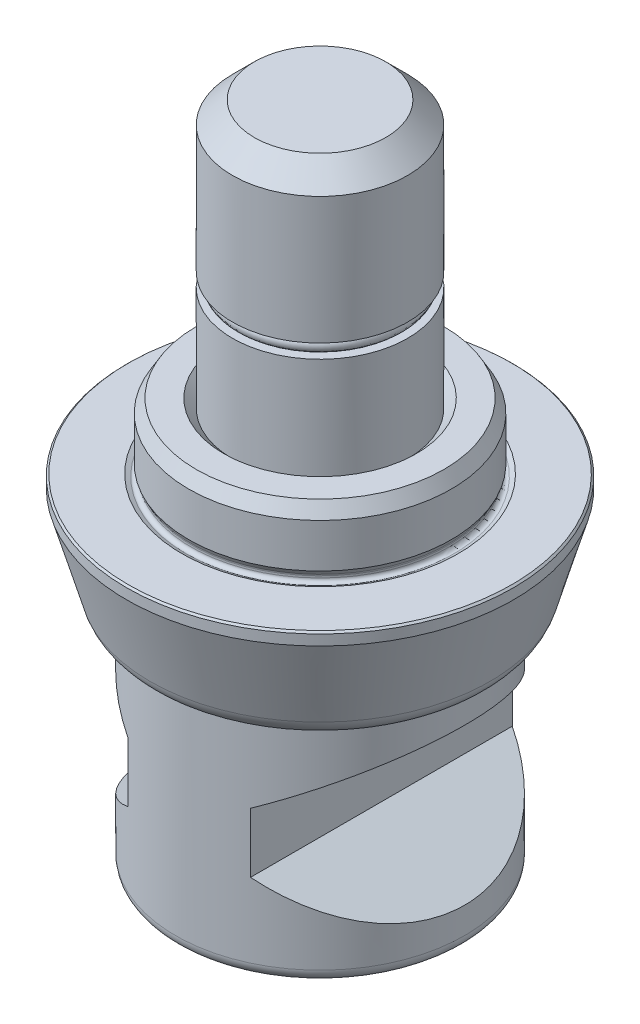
ISO-10303-21;
HEADER;
FILE_DESCRIPTION(('STEP AP214'),'2;1');
FILE_NAME('part.step','',(''),(''),'','','');
FILE_SCHEMA(('AUTOMOTIVE_DESIGN { 1 0 10303 214 1 1 1 1 }'));
ENDSEC;
DATA;
#1=APPLICATION_CONTEXT('core data for automotive mechanical design processes');
#2=APPLICATION_PROTOCOL_DEFINITION('international standard','automotive_design',2000,#1);
#3=PRODUCT_CONTEXT('',#1,'mechanical');
#4=PRODUCT('Part','Part','',(#3));
#5=PRODUCT_RELATED_PRODUCT_CATEGORY('part','',(#4));
#6=PRODUCT_DEFINITION_FORMATION('','',#4);
#7=PRODUCT_DEFINITION_CONTEXT('part definition',#1,'design');
#8=PRODUCT_DEFINITION('design','',#6,#7);
#9=PRODUCT_DEFINITION_SHAPE('','',#8);
#10=(LENGTH_UNIT() NAMED_UNIT(*) SI_UNIT(.MILLI.,.METRE.));
#11=(NAMED_UNIT(*) PLANE_ANGLE_UNIT() SI_UNIT($,.RADIAN.));
#12=(NAMED_UNIT(*) SI_UNIT($,.STERADIAN.) SOLID_ANGLE_UNIT());
#13=UNCERTAINTY_MEASURE_WITH_UNIT(LENGTH_MEASURE(1.E-05),#10,'distance_accuracy_value','');
#14=(GEOMETRIC_REPRESENTATION_CONTEXT(3) GLOBAL_UNCERTAINTY_ASSIGNED_CONTEXT((#13)) GLOBAL_UNIT_ASSIGNED_CONTEXT((#10,
#11,#12)) REPRESENTATION_CONTEXT('',''));
#15=CARTESIAN_POINT('',(0.,0.,0.));
#16=DIRECTION('',(0.,0.,1.));
#17=DIRECTION('',(1.,0.,0.));
#18=AXIS2_PLACEMENT_3D('',#15,#16,#17);
#19=CARTESIAN_POINT('',(0.,0.,0.));
#20=DIRECTION('',(0.,-1.,0.));
#21=DIRECTION('',(0.,0.,-1.));
#22=AXIS2_PLACEMENT_3D('',#19,#20,#21);
#23=CYLINDRICAL_SURFACE('',#22,15.);
#24=CARTESIAN_POINT('',(0.,1.,0.));
#25=DIRECTION('',(0.,-1.,0.));
#26=DIRECTION('',(0.,0.,-1.));
#27=AXIS2_PLACEMENT_3D('',#24,#25,#26);
#28=CIRCLE('',#27,15.);
#29=CARTESIAN_POINT('',(0.,1.,-15.));
#30=VERTEX_POINT('',#29);
#31=EDGE_CURVE('E662',#30,#30,#28,.T.);
#32=ORIENTED_EDGE('',*,*,#31,.F.);
#33=EDGE_LOOP('',(#32));
#34=FACE_BOUND('',#33,.T.);
#35=CARTESIAN_POINT('',(0.,6.,0.));
#36=DIRECTION('',(0.,1.,0.));
#37=DIRECTION('',(0.,0.,1.));
#38=AXIS2_PLACEMENT_3D('',#35,#36,#37);
#39=CIRCLE('',#38,15.);
#40=CARTESIAN_POINT('',(0.,6.,15.));
#41=VERTEX_POINT('',#40);
#42=EDGE_CURVE('E529',#41,#41,#39,.F.);
#43=ORIENTED_EDGE('',*,*,#42,.T.);
#44=EDGE_LOOP('',(#43));
#45=FACE_BOUND('',#44,.T.);
#46=ADVANCED_FACE('F16',(#34,#45),#23,.T.);
#47=CARTESIAN_POINT('',(15.,0.,0.));
#48=DIRECTION('',(0.,1.,0.));
#49=DIRECTION('',(0.,0.,1.));
#50=AXIS2_PLACEMENT_3D('',#47,#48,#49);
#51=PLANE('',#50);
#52=CARTESIAN_POINT('',(0.,0.,0.));
#53=DIRECTION('',(0.,-1.,0.));
#54=DIRECTION('',(0.,0.,-1.));
#55=AXIS2_PLACEMENT_3D('',#52,#53,#54);
#56=CIRCLE('',#55,15.774174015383);
#57=CARTESIAN_POINT('',(0.,0.,-15.774174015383));
#58=VERTEX_POINT('',#57);
#59=EDGE_CURVE('E648',#58,#58,#56,.T.);
#60=ORIENTED_EDGE('',*,*,#59,.T.);
#61=EDGE_LOOP('',(#60));
#62=FACE_BOUND('',#61,.T.);
#63=CARTESIAN_POINT('',(0.,0.,0.));
#64=DIRECTION('',(0.,1.,0.));
#65=DIRECTION('',(0.,0.,1.));
#66=AXIS2_PLACEMENT_3D('',#63,#64,#65);
#67=CIRCLE('',#66,21.9);
#68=CARTESIAN_POINT('',(0.,0.,21.9));
#69=VERTEX_POINT('',#68);
#70=EDGE_CURVE('E535',#69,#69,#67,.T.);
#71=ORIENTED_EDGE('',*,*,#70,.T.);
#72=EDGE_LOOP('',(#71));
#73=FACE_BOUND('',#72,.T.);
#74=ADVANCED_FACE('F484',(#62,#73),#51,.T.);
#75=CARTESIAN_POINT('',(0.,0.,0.));
#76=DIRECTION('',(0.,-1.,0.));
#77=DIRECTION('',(0.,0.,-1.));
#78=AXIS2_PLACEMENT_3D('',#75,#76,#77);
#79=CYLINDRICAL_SURFACE('',#78,22.1);
#80=CARTESIAN_POINT('',(0.,-0.199999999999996,0.));
#81=DIRECTION('',(0.,1.,0.));
#82=DIRECTION('',(0.,0.,1.));
#83=AXIS2_PLACEMENT_3D('',#80,#81,#82);
#84=CIRCLE('',#83,22.1);
#85=CARTESIAN_POINT('',(0.,-0.199999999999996,22.1));
#86=VERTEX_POINT('',#85);
#87=EDGE_CURVE('E526',#86,#86,#84,.F.);
#88=ORIENTED_EDGE('',*,*,#87,.T.);
#89=EDGE_LOOP('',(#88));
#90=FACE_BOUND('',#89,.T.);
#91=CARTESIAN_POINT('',(0.,-1.3949657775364,0.));
#92=DIRECTION('',(0.,-1.,0.));
#93=DIRECTION('',(0.,0.,-1.));
#94=AXIS2_PLACEMENT_3D('',#91,#92,#93);
#95=CIRCLE('',#94,22.1);
#96=CARTESIAN_POINT('',(0.,-1.3949657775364,-22.1));
#97=VERTEX_POINT('',#96);
#98=EDGE_CURVE('E639',#97,#97,#95,.T.);
#99=ORIENTED_EDGE('',*,*,#98,.F.);
#100=EDGE_LOOP('',(#99));
#101=FACE_BOUND('',#100,.T.);
#102=ADVANCED_FACE('F492',(#90,#101),#79,.T.);
#103=CARTESIAN_POINT('',(0.,-13.,0.));
#104=DIRECTION('',(0.,1.,0.));
#105=DIRECTION('',(0.,0.,1.));
#106=AXIS2_PLACEMENT_3D('',#103,#104,#105);
#107=CONICAL_SURFACE('',#106,18.7723099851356,0.279252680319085);
#108=CARTESIAN_POINT('',(0.,-10.826912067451,0.));
#109=DIRECTION('',(0.,-1.,0.));
#110=DIRECTION('',(0.,0.,-1.));
#111=AXIS2_PLACEMENT_3D('',#108,#109,#110);
#112=CIRCLE('',#111,19.3954329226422);
#113=CARTESIAN_POINT('',(0.,-10.826912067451,-19.3954329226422));
#114=VERTEX_POINT('',#113);
#115=EDGE_CURVE('E645',#114,#114,#112,.F.);
#116=ORIENTED_EDGE('',*,*,#115,.T.);
#117=EDGE_LOOP('',(#116));
#118=FACE_BOUND('',#117,.T.);
#119=ORIENTED_EDGE('',*,*,#98,.T.);
#120=EDGE_LOOP('',(#119));
#121=FACE_BOUND('',#120,.T.);
#122=ADVANCED_FACE('F628',(#118,#121),#107,.T.);
#123=CARTESIAN_POINT('',(10.,-13.,0.));
#124=DIRECTION('',(0.,-1.,0.));
#125=DIRECTION('',(0.,0.,-1.));
#126=AXIS2_PLACEMENT_3D('',#123,#124,#125);
#127=PLANE('',#126);
#128=CARTESIAN_POINT('',(0.,-13.,0.));
#129=DIRECTION('',(0.,-1.,0.));
#130=DIRECTION('',(0.,0.,-1.));
#131=AXIS2_PLACEMENT_3D('',#128,#129,#130);
#132=CIRCLE('',#131,16.);
#133=CARTESIAN_POINT('',(0.,-13.,-16.));
#134=VERTEX_POINT('',#133);
#135=EDGE_CURVE('E538',#134,#134,#132,.T.);
#136=ORIENTED_EDGE('',*,*,#135,.F.);
#137=EDGE_LOOP('',(#136));
#138=FACE_BOUND('',#137,.T.);
#139=CARTESIAN_POINT('',(0.,-13.,0.));
#140=DIRECTION('',(0.,-1.,0.));
#141=DIRECTION('',(0.,0.,-1.));
#142=AXIS2_PLACEMENT_3D('',#139,#140,#141);
#143=CIRCLE('',#142,16.5116478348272);
#144=CARTESIAN_POINT('',(0.,-13.,-16.5116478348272));
#145=VERTEX_POINT('',#144);
#146=EDGE_CURVE('E641',#145,#145,#143,.T.);
#147=ORIENTED_EDGE('',*,*,#146,.T.);
#148=EDGE_LOOP('',(#147));
#149=FACE_BOUND('',#148,.T.);
#150=ADVANCED_FACE('F625',(#138,#149),#127,.T.);
#151=CARTESIAN_POINT('',(10.,7.5,0.));
#152=DIRECTION('',(0.,1.,0.));
#153=DIRECTION('',(0.,0.,1.));
#154=AXIS2_PLACEMENT_3D('',#151,#152,#153);
#155=PLANE('',#154);
#156=CARTESIAN_POINT('',(0.,7.5,0.));
#157=DIRECTION('',(0.,1.,0.));
#158=DIRECTION('',(0.,0.,1.));
#159=AXIS2_PLACEMENT_3D('',#156,#157,#158);
#160=CIRCLE('',#159,11.);
#161=CARTESIAN_POINT('',(0.,7.5,11.));
#162=VERTEX_POINT('',#161);
#163=EDGE_CURVE('E522',#162,#162,#160,.F.);
#164=ORIENTED_EDGE('',*,*,#163,.T.);
#165=EDGE_LOOP('',(#164));
#166=FACE_BOUND('',#165,.T.);
#167=CARTESIAN_POINT('',(0.,7.5,0.));
#168=DIRECTION('',(0.,1.,0.));
#169=DIRECTION('',(0.,0.,1.));
#170=AXIS2_PLACEMENT_3D('',#167,#168,#169);
#171=CIRCLE('',#170,14.1339745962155);
#172=CARTESIAN_POINT('',(0.,7.5,14.1339745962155));
#173=VERTEX_POINT('',#172);
#174=EDGE_CURVE('E524',#173,#173,#171,.T.);
#175=ORIENTED_EDGE('',*,*,#174,.T.);
#176=EDGE_LOOP('',(#175));
#177=FACE_BOUND('',#176,.T.);
#178=ADVANCED_FACE('F503',(#166,#177),#155,.T.);
#179=CARTESIAN_POINT('',(0.,-10.,0.));
#180=DIRECTION('',(0.,-1.,0.));
#181=DIRECTION('',(0.,0.,-1.));
#182=AXIS2_PLACEMENT_3D('',#179,#180,#181);
#183=TOROIDAL_SURFACE('',#182,16.5116478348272,3.);
#184=ORIENTED_EDGE('',*,*,#115,.F.);
#185=EDGE_LOOP('',(#184));
#186=FACE_BOUND('',#185,.T.);
#187=ORIENTED_EDGE('',*,*,#146,.F.);
#188=EDGE_LOOP('',(#187));
#189=FACE_BOUND('',#188,.T.);
#190=ADVANCED_FACE('F499',(#186,#189),#183,.T.);
#191=CARTESIAN_POINT('',(0.,6.,0.));
#192=DIRECTION('',(0.,-1.,0.));
#193=DIRECTION('',(0.,0.,-1.));
#194=AXIS2_PLACEMENT_3D('',#191,#192,#193);
#195=CONICAL_SURFACE('',#194,15.,0.523598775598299);
#196=ORIENTED_EDGE('',*,*,#174,.F.);
#197=EDGE_LOOP('',(#196));
#198=FACE_BOUND('',#197,.T.);
#199=ORIENTED_EDGE('',*,*,#42,.F.);
#200=EDGE_LOOP('',(#199));
#201=FACE_BOUND('',#200,.T.);
#202=ADVANCED_FACE('F502',(#198,#201),#195,.T.);
#203=CARTESIAN_POINT('',(0.,7.5,0.));
#204=DIRECTION('',(0.,1.,0.));
#205=DIRECTION('',(0.,0.,1.));
#206=AXIS2_PLACEMENT_3D('',#203,#204,#205);
#207=CONICAL_SURFACE('',#206,11.,0.785398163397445);
#208=CARTESIAN_POINT('',(0.,6.5,0.));
#209=DIRECTION('',(0.,1.,0.));
#210=DIRECTION('',(0.,0.,1.));
#211=AXIS2_PLACEMENT_3D('',#208,#209,#210);
#212=CIRCLE('',#211,10.);
#213=CARTESIAN_POINT('',(0.,6.5,10.));
#214=VERTEX_POINT('',#213);
#215=EDGE_CURVE('E519',#214,#214,#212,.T.);
#216=ORIENTED_EDGE('',*,*,#215,.F.);
#217=EDGE_LOOP('',(#216));
#218=FACE_BOUND('',#217,.T.);
#219=ORIENTED_EDGE('',*,*,#163,.F.);
#220=EDGE_LOOP('',(#219));
#221=FACE_BOUND('',#220,.T.);
#222=ADVANCED_FACE('F506',(#218,#221),#207,.F.);
#223=CARTESIAN_POINT('',(0.,-0.199999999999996,0.));
#224=DIRECTION('',(0.,-1.,0.));
#225=DIRECTION('',(0.,0.,-1.));
#226=AXIS2_PLACEMENT_3D('',#223,#224,#225);
#227=CONICAL_SURFACE('',#226,22.1,0.785398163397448);
#228=ORIENTED_EDGE('',*,*,#70,.F.);
#229=EDGE_LOOP('',(#228));
#230=FACE_BOUND('',#229,.T.);
#231=ORIENTED_EDGE('',*,*,#87,.F.);
#232=EDGE_LOOP('',(#231));
#233=FACE_BOUND('',#232,.T.);
#234=ADVANCED_FACE('F18',(#230,#233),#227,.T.);
#235=CARTESIAN_POINT('',(0.,0.1,0.));
#236=DIRECTION('',(0.,-1.,0.));
#237=DIRECTION('',(0.,0.,-1.));
#238=AXIS2_PLACEMENT_3D('',#235,#236,#237);
#239=TOROIDAL_SURFACE('',#238,15.1,0.4);
#240=CARTESIAN_POINT('',(0.,-0.254804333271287,0.));
#241=DIRECTION('',(0.,-1.,0.));
#242=DIRECTION('',(0.,0.,-1.));
#243=AXIS2_PLACEMENT_3D('',#240,#241,#242);
#244=CIRCLE('',#243,15.284699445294);
#245=CARTESIAN_POINT('',(0.,-0.254804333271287,-15.284699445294));
#246=VERTEX_POINT('',#245);
#247=EDGE_CURVE('E642',#246,#246,#244,.T.);
#248=ORIENTED_EDGE('',*,*,#247,.F.);
#249=EDGE_LOOP('',(#248));
#250=FACE_BOUND('',#249,.T.);
#251=CARTESIAN_POINT('',(0.,0.1,0.));
#252=DIRECTION('',(0.,-1.,0.));
#253=DIRECTION('',(0.,0.,-1.));
#254=AXIS2_PLACEMENT_3D('',#251,#252,#253);
#255=CIRCLE('',#254,14.7);
#256=CARTESIAN_POINT('',(0.,0.1,-14.7));
#257=VERTEX_POINT('',#256);
#258=EDGE_CURVE('E671',#257,#257,#255,.T.);
#259=ORIENTED_EDGE('',*,*,#258,.T.);
#260=EDGE_LOOP('',(#259));
#261=FACE_BOUND('',#260,.T.);
#262=ADVANCED_FACE('F514',(#250,#261),#239,.F.);
#263=CARTESIAN_POINT('',(0.,-0.254804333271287,0.));
#264=DIRECTION('',(0.,1.,0.));
#265=DIRECTION('',(0.,0.,1.));
#266=AXIS2_PLACEMENT_3D('',#263,#264,#265);
#267=CONICAL_SURFACE('',#266,15.284699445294,1.09083078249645);
#268=ORIENTED_EDGE('',*,*,#59,.F.);
#269=EDGE_LOOP('',(#268));
#270=FACE_BOUND('',#269,.T.);
#271=ORIENTED_EDGE('',*,*,#247,.T.);
#272=EDGE_LOOP('',(#271));
#273=FACE_BOUND('',#272,.T.);
#274=ADVANCED_FACE('F615',(#270,#273),#267,.F.);
#275=CARTESIAN_POINT('',(0.,1.,0.));
#276=DIRECTION('',(0.,1.,0.));
#277=DIRECTION('',(0.,0.,1.));
#278=AXIS2_PLACEMENT_3D('',#275,#276,#277);
#279=CONICAL_SURFACE('',#278,15.,0.47123889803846);
#280=CARTESIAN_POINT('',(0.,0.496781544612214,0.));
#281=DIRECTION('',(0.,-1.,0.));
#282=DIRECTION('',(0.,0.,-1.));
#283=AXIS2_PLACEMENT_3D('',#280,#281,#282);
#284=CIRCLE('',#283,14.7435973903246);
#285=CARTESIAN_POINT('',(0.,0.496781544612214,-14.7435973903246));
#286=VERTEX_POINT('',#285);
#287=EDGE_CURVE('E665',#286,#286,#284,.T.);
#288=ORIENTED_EDGE('',*,*,#287,.F.);
#289=EDGE_LOOP('',(#288));
#290=FACE_BOUND('',#289,.T.);
#291=ORIENTED_EDGE('',*,*,#31,.T.);
#292=EDGE_LOOP('',(#291));
#293=FACE_BOUND('',#292,.T.);
#294=ADVANCED_FACE('F611',(#290,#293),#279,.T.);
#295=CARTESIAN_POINT('',(0.,0.315185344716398,0.));
#296=DIRECTION('',(0.,-1.,0.));
#297=DIRECTION('',(0.,0.,-1.));
#298=AXIS2_PLACEMENT_3D('',#295,#296,#297);
#299=TOROIDAL_SURFACE('',#298,15.1,0.4);
#300=CARTESIAN_POINT('',(0.,0.315185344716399,0.));
#301=DIRECTION('',(0.,-1.,0.));
#302=DIRECTION('',(0.,0.,-1.));
#303=AXIS2_PLACEMENT_3D('',#300,#301,#302);
#304=CIRCLE('',#303,14.7);
#305=CARTESIAN_POINT('',(0.,0.315185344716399,-14.7));
#306=VERTEX_POINT('',#305);
#307=EDGE_CURVE('E668',#306,#306,#304,.T.);
#308=ORIENTED_EDGE('',*,*,#307,.F.);
#309=EDGE_LOOP('',(#308));
#310=FACE_BOUND('',#309,.T.);
#311=ORIENTED_EDGE('',*,*,#287,.T.);
#312=EDGE_LOOP('',(#311));
#313=FACE_BOUND('',#312,.T.);
#314=ADVANCED_FACE('F607',(#310,#313),#299,.F.);
#315=CARTESIAN_POINT('',(0.,0.,0.));
#316=DIRECTION('',(0.,-1.,0.));
#317=DIRECTION('',(0.,0.,-1.));
#318=AXIS2_PLACEMENT_3D('',#315,#316,#317);
#319=CYLINDRICAL_SURFACE('',#318,14.7);
#320=ORIENTED_EDGE('',*,*,#258,.F.);
#321=EDGE_LOOP('',(#320));
#322=FACE_BOUND('',#321,.T.);
#323=ORIENTED_EDGE('',*,*,#307,.T.);
#324=EDGE_LOOP('',(#323));
#325=FACE_BOUND('',#324,.T.);
#326=ADVANCED_FACE('F550',(#322,#325),#319,.T.);
#327=CARTESIAN_POINT('',(10.,18.4,0.));
#328=DIRECTION('',(0.,-1.,0.));
#329=DIRECTION('',(0.,0.,-1.));
#330=AXIS2_PLACEMENT_3D('',#327,#328,#329);
#331=PLANE('',#330);
#332=CARTESIAN_POINT('',(0.,18.4,0.));
#333=DIRECTION('',(0.,-1.,0.));
#334=DIRECTION('',(0.,0.,-1.));
#335=AXIS2_PLACEMENT_3D('',#332,#333,#334);
#336=CIRCLE('',#335,8.75);
#337=CARTESIAN_POINT('',(0.,18.4,-8.75));
#338=VERTEX_POINT('',#337);
#339=EDGE_CURVE('E24',#338,#338,#336,.F.);
#340=ORIENTED_EDGE('',*,*,#339,.F.);
#341=EDGE_LOOP('',(#340));
#342=FACE_BOUND('',#341,.T.);
#343=CARTESIAN_POINT('',(0.,18.4,0.));
#344=DIRECTION('',(0.,-1.,0.));
#345=DIRECTION('',(0.,0.,-1.));
#346=AXIS2_PLACEMENT_3D('',#343,#344,#345);
#347=CIRCLE('',#346,10.);
#348=CARTESIAN_POINT('',(0.,18.4,-10.));
#349=VERTEX_POINT('',#348);
#350=EDGE_CURVE('E362',#349,#349,#347,.T.);
#351=ORIENTED_EDGE('',*,*,#350,.F.);
#352=EDGE_LOOP('',(#351));
#353=FACE_BOUND('',#352,.T.);
#354=ADVANCED_FACE('F546',(#342,#353),#331,.F.);
#355=CARTESIAN_POINT('',(0.,-13.,0.));
#356=DIRECTION('',(0.,-1.,0.));
#357=DIRECTION('',(0.,0.,-1.));
#358=AXIS2_PLACEMENT_3D('',#355,#356,#357);
#359=CYLINDRICAL_SURFACE('',#358,10.);
#360=ORIENTED_EDGE('',*,*,#350,.T.);
#361=EDGE_LOOP('',(#360));
#362=FACE_BOUND('',#361,.T.);
#363=ORIENTED_EDGE('',*,*,#215,.T.);
#364=EDGE_LOOP('',(#363));
#365=FACE_BOUND('',#364,.T.);
#366=ADVANCED_FACE('F549',(#362,#365),#359,.T.);
#367=CARTESIAN_POINT('',(16.5,-38.9,0.));
#368=DIRECTION('',(0.,-1.,0.));
#369=DIRECTION('',(0.,0.,-1.));
#370=AXIS2_PLACEMENT_3D('',#367,#368,#369);
#371=PLANE('',#370);
#372=CARTESIAN_POINT('',(10.6893213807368,-38.9,4.93069951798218));
#373=CARTESIAN_POINT('',(10.6187363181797,-38.9,4.91262329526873));
#374=CARTESIAN_POINT('',(10.4833112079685,-38.9,4.8779420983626));
#375=CARTESIAN_POINT('',(10.2929381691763,-38.9,4.81377090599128));
#376=CARTESIAN_POINT('',(10.1216299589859,-38.9,4.74656599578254));
#377=CARTESIAN_POINT('',(9.97117401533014,-38.9,4.67162061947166));
#378=CARTESIAN_POINT('',(9.83925692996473,-38.9,4.59306373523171));
#379=CARTESIAN_POINT('',(9.72781064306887,-38.9,4.50756230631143));
#380=CARTESIAN_POINT('',(9.63527612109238,-38.9,4.41674468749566));
#381=CARTESIAN_POINT('',(9.58871595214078,-38.9,4.34837624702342));
#382=CARTESIAN_POINT('',(9.5663550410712,-38.9,4.31554173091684));
#383=B_SPLINE_CURVE_WITH_KNOTS('',3,(#372,#373,#374,#375,#376,#377,#378,#379,#380,#381,#382),
.UNSPECIFIED.,.F.,.F.,(4,1,1,1,1,1,1,1,4),(0.,0.166836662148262,0.320094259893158,
0.459852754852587,0.587984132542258,0.704714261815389,0.810917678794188,0.909191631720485,1.),.UNSPECIFIED.);
#384=CARTESIAN_POINT('',(10.6893213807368,-38.9,4.93069951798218));
#385=VERTEX_POINT('',#384);
#386=CARTESIAN_POINT('',(9.5663550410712,-38.9,4.31554173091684));
#387=VERTEX_POINT('',#386);
#388=EDGE_CURVE('E725',#385,#387,#383,.T.);
#389=ORIENTED_EDGE('',*,*,#388,.T.);
#390=CARTESIAN_POINT('',(9.5663550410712,-38.9,4.31554173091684));
#391=CARTESIAN_POINT('',(9.54443528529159,-38.9,4.27549423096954));
#392=CARTESIAN_POINT('',(9.50211184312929,-38.9,4.19816909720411));
#393=CARTESIAN_POINT('',(9.46778390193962,-38.9,4.07286134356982));
#394=CARTESIAN_POINT('',(9.45590536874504,-38.9,3.94734563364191));
#395=CARTESIAN_POINT('',(9.47166339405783,-38.9,3.8660938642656));
#396=CARTESIAN_POINT('',(9.47954218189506,-38.9,3.82546913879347));
#397=B_SPLINE_CURVE_WITH_KNOTS('',3,(#390,#391,#392,#393,#394,#395,#396),.UNSPECIFIED.,.F.,.F.,
(4,1,1,1,4),(0.,0.267292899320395,0.516098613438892,0.758056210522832,1.),.UNSPECIFIED.);
#398=CARTESIAN_POINT('',(9.47954218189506,-38.9,3.82546913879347));
#399=VERTEX_POINT('',#398);
#400=EDGE_CURVE('E31',#387,#399,#397,.T.);
#401=ORIENTED_EDGE('',*,*,#400,.T.);
#402=CARTESIAN_POINT('',(9.47954218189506,-38.9,3.82546913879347));
#403=CARTESIAN_POINT('',(9.49192921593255,-38.9,3.78619091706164));
#404=CARTESIAN_POINT('',(9.51666906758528,-38.9,3.7077429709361));
#405=CARTESIAN_POINT('',(9.58344895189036,-38.9,3.60145998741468));
#406=CARTESIAN_POINT('',(9.67331975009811,-38.9,3.50771371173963));
#407=CARTESIAN_POINT('',(9.74667726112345,-38.9,3.45881470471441));
#408=CARTESIAN_POINT('',(9.78478739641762,-38.9,3.43341106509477));
#409=B_SPLINE_CURVE_WITH_KNOTS('',3,(#402,#403,#404,#405,#406,#407,#408),.UNSPECIFIED.,.F.,.F.,
(4,1,1,1,4),(0.,0.241563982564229,0.482460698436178,0.731131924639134,1.),.UNSPECIFIED.);
#410=CARTESIAN_POINT('',(9.78478739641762,-38.9,3.43341106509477));
#411=VERTEX_POINT('',#410);
#412=EDGE_CURVE('E35',#399,#411,#409,.T.);
#413=ORIENTED_EDGE('',*,*,#412,.T.);
#414=CARTESIAN_POINT('',(9.78478739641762,-38.9,3.43341106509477));
#415=CARTESIAN_POINT('',(9.82003941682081,-38.9,3.41444379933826));
#416=CARTESIAN_POINT('',(9.89299201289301,-38.9,3.37519182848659));
#417=CARTESIAN_POINT('',(10.0176029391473,-38.9,3.33859033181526));
#418=CARTESIAN_POINT('',(10.1559608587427,-38.9,3.31445025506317));
#419=CARTESIAN_POINT('',(10.309296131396,-38.9,3.3047340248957));
#420=CARTESIAN_POINT('',(10.4775558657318,-38.9,3.31034841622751));
#421=CARTESIAN_POINT('',(10.6605286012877,-38.9,3.3296411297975));
#422=CARTESIAN_POINT('',(10.8589001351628,-38.9,3.36216029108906));
#423=CARTESIAN_POINT('',(10.9947458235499,-38.9,3.39427735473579));
#424=CARTESIAN_POINT('',(11.0655104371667,-38.9,3.4110077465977));
#425=B_SPLINE_CURVE_WITH_KNOTS('',3,(#414,#415,#416,#417,#418,#419,#420,#421,#422,#423,#424),
.UNSPECIFIED.,.F.,.F.,(4,1,1,1,1,1,1,1,4),(0.,0.0914273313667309,0.18920507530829,
0.295541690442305,0.412625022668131,0.54018043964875,0.680520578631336,0.833577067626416,1.),.UNSPECIFIED.);
#426=CARTESIAN_POINT('',(11.0655104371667,-38.9,3.4110077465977));
#427=VERTEX_POINT('',#426);
#428=EDGE_CURVE('E683',#411,#427,#425,.T.);
#429=ORIENTED_EDGE('',*,*,#428,.T.);
#430=DIRECTION('',(0.970801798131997,0.,0.239883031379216));
#431=VECTOR('',#430,1.);
#432=CARTESIAN_POINT('',(11.0655104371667,-38.9,3.4110077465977));
#433=LINE('',#432,#431);
#434=CARTESIAN_POINT('',(11.6283938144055,-38.9,3.55009501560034));
#435=VERTEX_POINT('',#434);
#436=EDGE_CURVE('E690',#427,#435,#433,.T.);
#437=ORIENTED_EDGE('',*,*,#436,.T.);
#438=CARTESIAN_POINT('',(11.6283938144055,-38.9,3.55009501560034));
#439=CARTESIAN_POINT('',(11.6970691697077,-38.9,3.56831647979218));
#440=CARTESIAN_POINT('',(11.8289077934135,-38.9,3.6032968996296));
#441=CARTESIAN_POINT('',(12.0158777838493,-38.9,3.66596824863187));
#442=CARTESIAN_POINT('',(12.1844624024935,-38.9,3.73532849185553));
#443=CARTESIAN_POINT('',(12.3338728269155,-38.9,3.81276202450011));
#444=CARTESIAN_POINT('',(12.4655787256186,-38.9,3.89553386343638));
#445=CARTESIAN_POINT('',(12.5771204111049,-38.9,3.98695379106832));
#446=CARTESIAN_POINT('',(12.6728651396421,-38.9,4.08317607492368));
#447=CARTESIAN_POINT('',(12.721301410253,-38.9,4.15601414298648));
#448=CARTESIAN_POINT('',(12.7448258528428,-38.9,4.19139000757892));
#449=B_SPLINE_CURVE_WITH_KNOTS('',3,(#438,#439,#440,#441,#442,#443,#444,#445,#446,#447,#448),
.UNSPECIFIED.,.F.,.F.,(4,1,1,1,1,1,1,1,4),(0.,0.161614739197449,0.310257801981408,
0.448299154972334,0.575896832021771,0.692737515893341,0.801418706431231,0.903553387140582,1.),.UNSPECIFIED.);
#450=CARTESIAN_POINT('',(12.7448258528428,-38.9,4.19139000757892));
#451=VERTEX_POINT('',#450);
#452=EDGE_CURVE('E695',#435,#451,#449,.T.);
#453=ORIENTED_EDGE('',*,*,#452,.T.);
#454=CARTESIAN_POINT('',(12.7448258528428,-38.9,4.19139000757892));
#455=CARTESIAN_POINT('',(12.7664988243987,-38.9,4.23088363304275));
#456=CARTESIAN_POINT('',(12.808104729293,-38.9,4.30670009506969));
#457=CARTESIAN_POINT('',(12.8450126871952,-38.9,4.42629886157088));
#458=CARTESIAN_POINT('',(12.8576410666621,-38.9,4.54413524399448));
#459=CARTESIAN_POINT('',(12.844013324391,-38.9,4.61903120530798));
#460=CARTESIAN_POINT('',(12.8372395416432,-38.9,4.65625886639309));
#461=B_SPLINE_CURVE_WITH_KNOTS('',3,(#454,#455,#456,#457,#458,#459,#460),.UNSPECIFIED.,.F.,.F.,
(4,1,1,1,4),(0.,0.27733065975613,0.532395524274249,0.767573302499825,1.),.UNSPECIFIED.);
#462=CARTESIAN_POINT('',(12.8372395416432,-38.9,4.65625886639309));
#463=VERTEX_POINT('',#462);
#464=EDGE_CURVE('E699',#451,#463,#461,.T.);
#465=ORIENTED_EDGE('',*,*,#464,.T.);
#466=CARTESIAN_POINT('',(12.8372395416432,-38.9,4.65625886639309));
#467=CARTESIAN_POINT('',(12.8248962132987,-38.9,4.69586520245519));
#468=CARTESIAN_POINT('',(12.800330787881,-38.9,4.77468887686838));
#469=CARTESIAN_POINT('',(12.7333160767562,-38.9,4.88119580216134));
#470=CARTESIAN_POINT('',(12.643466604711,-38.9,4.97494934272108));
#471=CARTESIAN_POINT('',(12.5701060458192,-38.9,5.02384731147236));
#472=CARTESIAN_POINT('',(12.5319943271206,-38.9,5.04925041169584));
#473=B_SPLINE_CURVE_WITH_KNOTS('',3,(#466,#467,#468,#469,#470,#471,#472),.UNSPECIFIED.,.F.,.F.,
(4,1,1,1,4),(0.,0.242867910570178,0.483350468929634,0.731594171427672,1.),.UNSPECIFIED.);
#474=CARTESIAN_POINT('',(12.5319943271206,-38.9,5.04925041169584));
#475=VERTEX_POINT('',#474);
#476=EDGE_CURVE('E706',#463,#475,#473,.T.);
#477=ORIENTED_EDGE('',*,*,#476,.T.);
#478=CARTESIAN_POINT('',(12.5319943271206,-38.9,5.04925041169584));
#479=CARTESIAN_POINT('',(12.4967011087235,-38.9,5.0678133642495));
#480=CARTESIAN_POINT('',(12.4237963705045,-38.9,5.1061586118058));
#481=CARTESIAN_POINT('',(12.2998878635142,-38.9,5.14336704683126));
#482=CARTESIAN_POINT('',(12.1617316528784,-38.9,5.1672379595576));
#483=CARTESIAN_POINT('',(12.0084328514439,-38.9,5.17694060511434));
#484=CARTESIAN_POINT('',(11.8400934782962,-38.9,5.17167421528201));
#485=CARTESIAN_POINT('',(11.6572582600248,-38.9,5.15078650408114));
#486=CARTESIAN_POINT('',(11.4588037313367,-38.9,5.11874043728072));
#487=CARTESIAN_POINT('',(11.3229654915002,-38.9,5.08655355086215));
#488=CARTESIAN_POINT('',(11.2522047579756,-38.9,5.06978678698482));
#489=B_SPLINE_CURVE_WITH_KNOTS('',3,(#478,#479,#480,#481,#482,#483,#484,#485,#486,#487,#488),
.UNSPECIFIED.,.F.,.F.,(4,1,1,1,1,1,1,1,4),(0.,0.0911970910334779,0.188384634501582,
0.294819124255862,0.412010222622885,0.539683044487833,0.680226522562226,0.833423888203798,1.),.UNSPECIFIED.);
#490=CARTESIAN_POINT('',(11.2522047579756,-38.9,5.06978678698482));
#491=VERTEX_POINT('',#490);
#492=EDGE_CURVE('E713',#475,#491,#489,.T.);
#493=ORIENTED_EDGE('',*,*,#492,.T.);
#494=DIRECTION('',(-0.970801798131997,0.,-0.239883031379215));
#495=VECTOR('',#494,1.);
#496=CARTESIAN_POINT('',(11.2522047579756,-38.9,5.06978678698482));
#497=LINE('',#496,#495);
#498=EDGE_CURVE('E720',#491,#385,#497,.T.);
#499=ORIENTED_EDGE('',*,*,#498,.T.);
#500=EDGE_LOOP('',(#389,#401,#413,#429,#437,#453,#465,#477,#493,#499));
#501=FACE_BOUND('',#500,.T.);
#502=ADVANCED_FACE('F556',(#501),#371,.T.);
#503=CARTESIAN_POINT('',(0.,-38.9,0.));
#504=DIRECTION('',(0.,1.,0.));
#505=DIRECTION('',(0.,0.,1.));
#506=AXIS2_PLACEMENT_3D('',#503,#504,#505);
#507=CIRCLE('',#506,5.);
#508=CARTESIAN_POINT('',(0.,-38.9,5.));
#509=VERTEX_POINT('',#508);
#510=EDGE_CURVE('E1394',#509,#509,#507,.T.);
#511=ORIENTED_EDGE('',*,*,#510,.T.);
#512=EDGE_LOOP('',(#511));
#513=FACE_BOUND('',#512,.T.);
#514=CARTESIAN_POINT('',(0.,-38.9,0.));
#515=DIRECTION('',(0.,-1.,0.));
#516=DIRECTION('',(0.,0.,-1.));
#517=AXIS2_PLACEMENT_3D('',#514,#515,#516);
#518=CIRCLE('',#517,15.);
#519=CARTESIAN_POINT('',(0.,-38.9,-15.));
#520=VERTEX_POINT('',#519);
#521=EDGE_CURVE('E402',#520,#520,#518,.T.);
#522=ORIENTED_EDGE('',*,*,#521,.T.);
#523=EDGE_LOOP('',(#522));
#524=FACE_BOUND('',#523,.T.);
#525=DIRECTION('',(0.161336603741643,0.,0.986899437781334));
#526=VECTOR('',#525,1.);
#527=CARTESIAN_POINT('',(8.51610282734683,-38.9,-2.65856856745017));
#528=LINE('',#527,#526);
#529=CARTESIAN_POINT('',(8.51610282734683,-38.9,-2.65856856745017));
#530=VERTEX_POINT('',#529);
#531=CARTESIAN_POINT('',(8.60384915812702,-38.9,-2.12182239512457));
#532=VERTEX_POINT('',#531);
#533=EDGE_CURVE('E326',#530,#532,#528,.T.);
#534=ORIENTED_EDGE('',*,*,#533,.T.);
#535=DIRECTION('',(0.987142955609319,0.,-0.159839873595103));
#536=VECTOR('',#535,1.);
#537=CARTESIAN_POINT('',(8.60384915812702,-38.9,-2.12182239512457));
#538=LINE('',#537,#536);
#539=CARTESIAN_POINT('',(9.12846019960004,-38.9,-2.20676831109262));
#540=VERTEX_POINT('',#539);
#541=EDGE_CURVE('E1035',#532,#540,#538,.T.);
#542=ORIENTED_EDGE('',*,*,#541,.T.);
#543=CARTESIAN_POINT('',(9.12846019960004,-38.9,-2.20676831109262));
#544=CARTESIAN_POINT('',(9.14643456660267,-38.9,-2.1290231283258));
#545=CARTESIAN_POINT('',(9.18121879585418,-38.9,-1.97856963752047));
#546=CARTESIAN_POINT('',(9.24821801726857,-38.9,-1.76421930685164));
#547=CARTESIAN_POINT('',(9.32242536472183,-38.9,-1.56734124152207));
#548=CARTESIAN_POINT('',(9.41001909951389,-38.9,-1.39008613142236));
#549=CARTESIAN_POINT('',(9.50606407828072,-38.9,-1.23044139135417));
#550=CARTESIAN_POINT('',(9.6113247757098,-38.9,-1.08850183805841));
#551=CARTESIAN_POINT('',(9.72757530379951,-38.9,-0.964974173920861));
#552=CARTESIAN_POINT('',(9.81459223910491,-38.9,-0.897014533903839));
#553=CARTESIAN_POINT('',(9.85750152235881,-38.9,-0.863502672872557));
#554=B_SPLINE_CURVE_WITH_KNOTS('',3,(#543,#544,#545,#546,#547,#548,#549,#550,#551,#552,#553),
.UNSPECIFIED.,.F.,.F.,(4,1,1,1,1,1,1,1,4),(0.,0.153177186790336,0.296430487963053,
0.430916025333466,0.556774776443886,0.675539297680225,0.788228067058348,0.895572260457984,1.),.UNSPECIFIED.);
#555=CARTESIAN_POINT('',(9.85750152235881,-38.9,-0.863502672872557));
#556=VERTEX_POINT('',#555);
#557=EDGE_CURVE('E1040',#540,#556,#554,.T.);
#558=ORIENTED_EDGE('',*,*,#557,.T.);
#559=CARTESIAN_POINT('',(9.85750152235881,-38.9,-0.863502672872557));
#560=CARTESIAN_POINT('',(9.90659860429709,-38.9,-0.830308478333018));
#561=CARTESIAN_POINT('',(10.0039282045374,-38.9,-0.76450461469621));
#562=CARTESIAN_POINT('',(10.1619109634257,-38.9,-0.686136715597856));
#563=CARTESIAN_POINT('',(10.326600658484,-38.9,-0.62396170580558));
#564=CARTESIAN_POINT('',(10.4995365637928,-38.9,-0.580317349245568));
#565=CARTESIAN_POINT('',(10.6799366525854,-38.9,-0.553224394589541));
#566=CARTESIAN_POINT('',(10.8677420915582,-38.9,-0.543245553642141));
#567=CARTESIAN_POINT('',(11.063428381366,-38.9,-0.550401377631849));
#568=CARTESIAN_POINT('',(11.1949795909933,-38.9,-0.569175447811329));
#569=CARTESIAN_POINT('',(11.2623762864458,-38.9,-0.578793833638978));
#570=B_SPLINE_CURVE_WITH_KNOTS('',3,(#559,#560,#561,#562,#563,#564,#565,#566,#567,#568,#569),
.UNSPECIFIED.,.F.,.F.,(4,1,1,1,1,1,1,1,4),(0.,0.120632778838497,0.239141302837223,
0.358304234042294,0.47869690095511,0.601796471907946,0.729411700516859,0.861371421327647,1.),.UNSPECIFIED.);
#571=CARTESIAN_POINT('',(11.2623762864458,-38.9,-0.578793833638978));
#572=VERTEX_POINT('',#571);
#573=EDGE_CURVE('E1044',#556,#572,#570,.T.);
#574=ORIENTED_EDGE('',*,*,#573,.T.);
#575=CARTESIAN_POINT('',(11.2623762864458,-38.9,-0.578793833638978));
#576=CARTESIAN_POINT('',(11.3292234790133,-38.9,-0.591006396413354));
#577=CARTESIAN_POINT('',(11.4598440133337,-38.9,-0.614869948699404));
#578=CARTESIAN_POINT('',(11.6472910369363,-38.9,-0.669546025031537));
#579=CARTESIAN_POINT('',(11.8222080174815,-38.9,-0.738036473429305));
#580=CARTESIAN_POINT('',(11.9850392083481,-38.9,-0.819606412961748));
#581=CARTESIAN_POINT('',(12.1346656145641,-38.9,-0.916748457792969));
#582=CARTESIAN_POINT('',(12.2715593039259,-38.9,-1.02725355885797));
#583=CARTESIAN_POINT('',(12.3962401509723,-38.9,-1.15192701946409));
#584=CARTESIAN_POINT('',(12.4678494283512,-38.9,-1.24507877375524));
#585=CARTESIAN_POINT('',(12.503893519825,-38.9,-1.29196613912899));
#586=B_SPLINE_CURVE_WITH_KNOTS('',3,(#575,#576,#577,#578,#579,#580,#581,#582,#583,#584,#585),
.UNSPECIFIED.,.F.,.F.,(4,1,1,1,1,1,1,1,4),(0.,0.13852023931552,0.270670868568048,
0.397473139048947,0.521213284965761,0.64143731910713,0.760567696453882,0.879483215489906,1.),.UNSPECIFIED.);
#587=CARTESIAN_POINT('',(12.503893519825,-38.9,-1.29196613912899));
#588=VERTEX_POINT('',#587);
#589=EDGE_CURVE('E1051',#572,#588,#586,.T.);
#590=ORIENTED_EDGE('',*,*,#589,.T.);
#591=CARTESIAN_POINT('',(12.503893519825,-38.9,-1.29196613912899));
#592=CARTESIAN_POINT('',(12.5340087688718,-38.9,-1.33733293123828));
#593=CARTESIAN_POINT('',(12.5951830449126,-38.9,-1.4294882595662));
#594=CARTESIAN_POINT('',(12.6664302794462,-38.9,-1.58335207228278));
#595=CARTESIAN_POINT('',(12.7225173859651,-38.9,-1.75091934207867));
#596=CARTESIAN_POINT('',(12.7630993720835,-38.9,-1.93270769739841));
#597=CARTESIAN_POINT('',(12.7889692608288,-38.9,-2.12886601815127));
#598=CARTESIAN_POINT('',(12.7994081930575,-38.9,-2.33918307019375));
#599=CARTESIAN_POINT('',(12.7961471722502,-38.9,-2.56380567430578));
#600=CARTESIAN_POINT('',(12.781318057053,-38.9,-2.71744861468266));
#601=CARTESIAN_POINT('',(12.7736668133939,-38.9,-2.79672236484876));
#602=B_SPLINE_CURVE_WITH_KNOTS('',3,(#591,#592,#593,#594,#595,#596,#597,#598,#599,#600,#601),
.UNSPECIFIED.,.F.,.F.,(4,1,1,1,1,1,1,1,4),(0.,0.104422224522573,0.212116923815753,
0.324332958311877,0.443172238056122,0.56914456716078,0.703750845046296,0.847147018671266,1.),.UNSPECIFIED.);
#603=CARTESIAN_POINT('',(12.7736668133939,-38.9,-2.79672236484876));
#604=VERTEX_POINT('',#603);
#605=EDGE_CURVE('E1058',#588,#604,#602,.T.);
#606=ORIENTED_EDGE('',*,*,#605,.T.);
#607=DIRECTION('',(0.987094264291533,0.,-0.160140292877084));
#608=VECTOR('',#607,1.);
#609=CARTESIAN_POINT('',(12.7736668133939,-38.9,-2.79672236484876));
#610=LINE('',#609,#608);
#611=CARTESIAN_POINT('',(13.4756374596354,-38.9,-2.91060590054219));
#612=VERTEX_POINT('',#611);
#613=EDGE_CURVE('E1065',#604,#612,#610,.T.);
#614=ORIENTED_EDGE('',*,*,#613,.T.);
#615=DIRECTION('',(-0.161336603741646,0.,-0.986899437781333));
#616=VECTOR('',#615,1.);
#617=CARTESIAN_POINT('',(13.4756374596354,-38.9,-2.91060590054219));
#618=LINE('',#617,#616);
#619=CARTESIAN_POINT('',(13.3878911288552,-38.9,-3.44735207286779));
#620=VERTEX_POINT('',#619);
#621=EDGE_CURVE('E1070',#612,#620,#618,.T.);
#622=ORIENTED_EDGE('',*,*,#621,.T.);
#623=DIRECTION('',(-0.987094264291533,0.,0.160140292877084));
#624=VECTOR('',#623,1.);
#625=CARTESIAN_POINT('',(13.3878911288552,-38.9,-3.44735207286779));
#626=LINE('',#625,#624);
#627=CARTESIAN_POINT('',(12.6859204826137,-38.9,-3.33346853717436));
#628=VERTEX_POINT('',#627);
#629=EDGE_CURVE('E1072',#620,#628,#626,.T.);
#630=ORIENTED_EDGE('',*,*,#629,.T.);
#631=CARTESIAN_POINT('',(12.6859204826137,-38.9,-3.33346853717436));
#632=CARTESIAN_POINT('',(12.6681943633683,-38.9,-3.40901575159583));
#633=CARTESIAN_POINT('',(12.6338511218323,-38.9,-3.55538372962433));
#634=CARTESIAN_POINT('',(12.5684534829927,-38.9,-3.76421080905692));
#635=CARTESIAN_POINT('',(12.4931758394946,-38.9,-3.95497455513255));
#636=CARTESIAN_POINT('',(12.4082999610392,-38.9,-4.12804352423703));
#637=CARTESIAN_POINT('',(12.313054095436,-38.9,-4.28316029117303));
#638=CARTESIAN_POINT('',(12.2070692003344,-38.9,-4.42024173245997));
#639=CARTESIAN_POINT('',(12.0917923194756,-38.9,-4.5406165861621));
#640=CARTESIAN_POINT('',(12.0050857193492,-38.9,-4.60622385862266));
#641=CARTESIAN_POINT('',(11.9624799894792,-38.9,-4.6384618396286));
#642=B_SPLINE_CURVE_WITH_KNOTS('',3,(#631,#632,#633,#634,#635,#636,#637,#638,#639,#640,#641),
.UNSPECIFIED.,.F.,.F.,(4,1,1,1,1,1,1,1,4),(0.,0.152456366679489,0.295374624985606,
0.42958805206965,0.555106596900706,0.673721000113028,0.786611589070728,0.895145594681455,1.),.UNSPECIFIED.);
#643=CARTESIAN_POINT('',(11.9624799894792,-38.9,-4.6384618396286));
#644=VERTEX_POINT('',#643);
#645=EDGE_CURVE('E1074',#628,#644,#642,.T.);
#646=ORIENTED_EDGE('',*,*,#645,.T.);
#647=CARTESIAN_POINT('',(11.9624799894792,-38.9,-4.6384618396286));
#648=CARTESIAN_POINT('',(11.9133810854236,-38.9,-4.67164935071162));
#649=CARTESIAN_POINT('',(11.8160478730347,-38.9,-4.73743996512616));
#650=CARTESIAN_POINT('',(11.6580918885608,-38.9,-4.81590607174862));
#651=CARTESIAN_POINT('',(11.493227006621,-38.9,-4.87773335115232));
#652=CARTESIAN_POINT('',(11.3206013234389,-38.9,-4.92281392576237));
#653=CARTESIAN_POINT('',(11.1403636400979,-38.9,-4.94984590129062));
#654=CARTESIAN_POINT('',(10.9525184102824,-38.9,-4.95845027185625));
#655=CARTESIAN_POINT('',(10.7572356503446,-38.9,-4.95150600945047));
#656=CARTESIAN_POINT('',(10.6256351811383,-38.9,-4.93335727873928));
#657=CARTESIAN_POINT('',(10.5585386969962,-38.9,-4.92410415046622));
#658=B_SPLINE_CURVE_WITH_KNOTS('',3,(#647,#648,#649,#650,#651,#652,#653,#654,#655,#656,#657),
.UNSPECIFIED.,.F.,.F.,(4,1,1,1,1,1,1,1,4),(0.,0.12070285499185,0.239280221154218,
0.35851237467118,0.479133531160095,0.602304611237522,0.72932734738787,0.861997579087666,1.),.UNSPECIFIED.);
#659=CARTESIAN_POINT('',(10.5585386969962,-38.9,-4.92410415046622));
#660=VERTEX_POINT('',#659);
#661=EDGE_CURVE('E1078',#644,#660,#658,.T.);
#662=ORIENTED_EDGE('',*,*,#661,.T.);
#663=CARTESIAN_POINT('',(10.5585386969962,-38.9,-4.92410415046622));
#664=CARTESIAN_POINT('',(10.4916950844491,-38.9,-4.91188072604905));
#665=CARTESIAN_POINT('',(10.3610815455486,-38.9,-4.88799594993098));
#666=CARTESIAN_POINT('',(10.1731963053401,-38.9,-4.83335849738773));
#667=CARTESIAN_POINT('',(9.99835946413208,-38.9,-4.76422557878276));
#668=CARTESIAN_POINT('',(9.83556102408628,-38.9,-4.68184332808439));
#669=CARTESIAN_POINT('',(9.68541381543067,-38.9,-4.58554723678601));
#670=CARTESIAN_POINT('',(9.54845018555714,-38.9,-4.4746668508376));
#671=CARTESIAN_POINT('',(9.4237342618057,-38.9,-4.35004868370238));
#672=CARTESIAN_POINT('',(9.35212970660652,-38.9,-4.2568894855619));
#673=CARTESIAN_POINT('',(9.31608799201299,-38.9,-4.20999837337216));
#674=B_SPLINE_CURVE_WITH_KNOTS('',3,(#663,#664,#665,#666,#667,#668,#669,#670,#671,#672,#673),
.UNSPECIFIED.,.F.,.F.,(4,1,1,1,1,1,1,1,4),(0.,0.138410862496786,0.270457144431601,
0.397981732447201,0.521058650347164,0.64172044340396,0.76075675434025,0.879578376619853,1.),.UNSPECIFIED.);
#675=CARTESIAN_POINT('',(9.31608799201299,-38.9,-4.20999837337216));
#676=VERTEX_POINT('',#675);
#677=EDGE_CURVE('E1085',#660,#676,#674,.T.);
#678=ORIENTED_EDGE('',*,*,#677,.T.);
#679=CARTESIAN_POINT('',(9.31608799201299,-38.9,-4.20999837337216));
#680=CARTESIAN_POINT('',(9.2860421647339,-38.9,-4.16585830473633));
#681=CARTESIAN_POINT('',(9.22495474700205,-38.9,-4.07611530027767));
#682=CARTESIAN_POINT('',(9.15256296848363,-38.9,-3.92625528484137));
#683=CARTESIAN_POINT('',(9.09571943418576,-38.9,-3.76262328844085));
#684=CARTESIAN_POINT('',(9.05408885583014,-38.9,-3.58521969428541));
#685=CARTESIAN_POINT('',(9.02698990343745,-38.9,-3.39403439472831));
#686=CARTESIAN_POINT('',(9.01716284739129,-38.9,-3.18922984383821));
#687=CARTESIAN_POINT('',(9.01907465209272,-38.9,-2.97054674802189));
#688=CARTESIAN_POINT('',(9.033335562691,-38.9,-2.82092549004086));
#689=CARTESIAN_POINT('',(9.04071386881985,-38.9,-2.74351448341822));
#690=B_SPLINE_CURVE_WITH_KNOTS('',3,(#679,#680,#681,#682,#683,#684,#685,#686,#687,#688,#689),
.UNSPECIFIED.,.F.,.F.,(4,1,1,1,1,1,1,1,4),(0.,0.104819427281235,0.213112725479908,
0.325858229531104,0.444657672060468,0.570652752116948,0.70476673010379,0.847252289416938,1.),.UNSPECIFIED.);
#691=CARTESIAN_POINT('',(9.04071386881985,-38.9,-2.74351448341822));
#692=VERTEX_POINT('',#691);
#693=EDGE_CURVE('E1092',#676,#692,#690,.T.);
#694=ORIENTED_EDGE('',*,*,#693,.T.);
#695=DIRECTION('',(-0.987142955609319,0.,0.159839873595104));
#696=VECTOR('',#695,1.);
#697=CARTESIAN_POINT('',(9.04071386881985,-38.9,-2.74351448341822));
#698=LINE('',#697,#696);
#699=EDGE_CURVE('E1098',#692,#530,#698,.T.);
#700=ORIENTED_EDGE('',*,*,#699,.T.);
#701=EDGE_LOOP('',(#534,#542,#558,#574,#590,#606,#614,#622,#630,#646,#662,#678,#694,#700));
#702=FACE_BOUND('',#701,.T.);
#703=CARTESIAN_POINT('',(10.097154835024,-38.9,0.90754242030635));
#704=CARTESIAN_POINT('',(10.1161042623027,-38.9,0.892728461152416));
#705=CARTESIAN_POINT('',(10.1548429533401,-38.9,0.862443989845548));
#706=CARTESIAN_POINT('',(10.2213230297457,-38.9,0.825355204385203));
#707=CARTESIAN_POINT('',(10.2946546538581,-38.9,0.793508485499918));
#708=CARTESIAN_POINT('',(10.3760346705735,-38.9,0.769700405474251));
#709=CARTESIAN_POINT('',(10.4640471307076,-38.9,0.751111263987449));
#710=CARTESIAN_POINT('',(10.5594845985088,-38.9,0.738103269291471));
#711=CARTESIAN_POINT('',(10.6624373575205,-38.9,0.731558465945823));
#712=CARTESIAN_POINT('',(10.7334641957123,-38.9,0.732497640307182));
#713=CARTESIAN_POINT('',(10.7701878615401,-38.9,0.732983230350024));
#714=B_SPLINE_CURVE_WITH_KNOTS('',3,(#703,#704,#705,#706,#707,#708,#709,#710,#711,#712,#713),
.UNSPECIFIED.,.F.,.F.,(4,1,1,1,1,1,1,1,4),(0.,0.101452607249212,0.207401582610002,
0.320424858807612,0.438492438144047,0.564786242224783,0.700084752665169,0.844932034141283,1.),.UNSPECIFIED.);
#715=CARTESIAN_POINT('',(10.097154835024,-38.9,0.90754242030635));
#716=VERTEX_POINT('',#715);
#717=CARTESIAN_POINT('',(10.7701878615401,-38.9,0.732983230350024));
#718=VERTEX_POINT('',#717);
#719=EDGE_CURVE('E965',#716,#718,#714,.T.);
#720=ORIENTED_EDGE('',*,*,#719,.T.);
#721=DIRECTION('',(0.0805455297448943,0.,-0.996750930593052));
#722=VECTOR('',#721,1.);
#723=CARTESIAN_POINT('',(10.7701878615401,-38.9,0.732983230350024));
#724=LINE('',#723,#722);
#725=CARTESIAN_POINT('',(10.8149944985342,-38.9,0.178501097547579));
#726=VERTEX_POINT('',#725);
#727=EDGE_CURVE('E790',#718,#726,#724,.T.);
#728=ORIENTED_EDGE('',*,*,#727,.T.);
#729=CARTESIAN_POINT('',(10.8149944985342,-38.9,0.178501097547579));
#730=CARTESIAN_POINT('',(10.7677152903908,-38.9,0.17578946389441));
#731=CARTESIAN_POINT('',(10.6746959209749,-38.9,0.17045446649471));
#732=CARTESIAN_POINT('',(10.537083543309,-38.9,0.177059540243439));
#733=CARTESIAN_POINT('',(10.4048620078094,-38.9,0.196703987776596));
#734=CARTESIAN_POINT('',(10.277923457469,-38.9,0.228637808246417));
#735=CARTESIAN_POINT('',(10.1561282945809,-38.9,0.272469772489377));
#736=CARTESIAN_POINT('',(10.0399196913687,-38.9,0.32900019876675));
#737=CARTESIAN_POINT('',(9.92847405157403,-38.9,0.39695073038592));
#738=CARTESIAN_POINT('',(9.86070351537,-38.9,0.452124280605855));
#739=CARTESIAN_POINT('',(9.82644806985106,-38.9,0.480012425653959));
#740=B_SPLINE_CURVE_WITH_KNOTS('',3,(#729,#730,#731,#732,#733,#734,#735,#736,#737,#738,#739),
.UNSPECIFIED.,.F.,.F.,(4,1,1,1,1,1,1,1,4),(0.,0.13371632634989,0.263079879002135,
0.388389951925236,0.5107644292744,0.632277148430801,0.753366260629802,0.875335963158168,1.),.UNSPECIFIED.);
#741=CARTESIAN_POINT('',(9.82644806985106,-38.9,0.480012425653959));
#742=VERTEX_POINT('',#741);
#743=EDGE_CURVE('E795',#726,#742,#740,.T.);
#744=ORIENTED_EDGE('',*,*,#743,.T.);
#745=CARTESIAN_POINT('',(9.82644806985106,-38.9,0.480012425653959));
#746=CARTESIAN_POINT('',(9.79826193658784,-38.9,0.505652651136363));
#747=CARTESIAN_POINT('',(9.74266729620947,-38.9,0.556225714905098));
#748=CARTESIAN_POINT('',(9.66841826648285,-38.9,0.640209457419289));
#749=CARTESIAN_POINT('',(9.60342329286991,-38.9,0.729492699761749));
#750=CARTESIAN_POINT('',(9.55086450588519,-38.9,0.825901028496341));
#751=CARTESIAN_POINT('',(9.50477759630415,-38.9,0.925714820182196));
#752=CARTESIAN_POINT('',(9.47175675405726,-38.9,1.03256883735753));
#753=CARTESIAN_POINT('',(9.44709481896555,-38.9,1.14438164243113));
#754=CARTESIAN_POINT('',(9.43866149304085,-38.9,1.22138986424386));
#755=CARTESIAN_POINT('',(9.43438999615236,-38.9,1.26039468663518));
#756=B_SPLINE_CURVE_WITH_KNOTS('',3,(#745,#746,#747,#748,#749,#750,#751,#752,#753,#754,#755),
.UNSPECIFIED.,.F.,.F.,(4,1,1,1,1,1,1,1,4),(0.,0.12733006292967,0.251147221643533,
0.374153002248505,0.495724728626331,0.617740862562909,0.741133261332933,0.868883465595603,1.),.UNSPECIFIED.);
#757=CARTESIAN_POINT('',(9.43438999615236,-38.9,1.26039468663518));
#758=VERTEX_POINT('',#757);
#759=EDGE_CURVE('E799',#742,#758,#756,.T.);
#760=ORIENTED_EDGE('',*,*,#759,.T.);
#761=CARTESIAN_POINT('',(9.43438999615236,-38.9,1.26039468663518));
#762=CARTESIAN_POINT('',(9.43181001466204,-38.9,1.30549579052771));
#763=CARTESIAN_POINT('',(9.42675732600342,-38.9,1.3938227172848));
#764=CARTESIAN_POINT('',(9.43137388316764,-38.9,1.52348399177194));
#765=CARTESIAN_POINT('',(9.44703317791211,-38.9,1.64701066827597));
#766=CARTESIAN_POINT('',(9.47451233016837,-38.9,1.76408164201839));
#767=CARTESIAN_POINT('',(9.51109958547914,-38.9,1.8756257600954));
#768=CARTESIAN_POINT('',(9.56080920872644,-38.9,1.97987539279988));
#769=CARTESIAN_POINT('',(9.61894084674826,-38.9,2.07905864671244));
#770=CARTESIAN_POINT('',(9.66698114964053,-38.9,2.13871727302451));
#771=CARTESIAN_POINT('',(9.6910946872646,-38.9,2.1686625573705));
#772=B_SPLINE_CURVE_WITH_KNOTS('',3,(#761,#762,#763,#764,#765,#766,#767,#768,#769,#770,#771),
.UNSPECIFIED.,.F.,.F.,(4,1,1,1,1,1,1,1,4),(0.,0.139729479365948,0.273649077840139,
0.400837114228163,0.524387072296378,0.645263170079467,0.763283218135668,0.88118145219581,1.),.UNSPECIFIED.);
#773=CARTESIAN_POINT('',(9.6910946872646,-38.9,2.16866255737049));
#774=VERTEX_POINT('',#773);
#775=EDGE_CURVE('E806',#758,#774,#772,.T.);
#776=ORIENTED_EDGE('',*,*,#775,.T.);
#777=CARTESIAN_POINT('',(9.6910946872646,-38.9,2.16866255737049));
#778=CARTESIAN_POINT('',(9.7147706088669,-38.9,2.19508246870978));
#779=CARTESIAN_POINT('',(9.76189505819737,-38.9,2.24766854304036));
#780=CARTESIAN_POINT('',(9.84313123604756,-38.9,2.31592178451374));
#781=CARTESIAN_POINT('',(9.931395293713,-38.9,2.37482971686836));
#782=CARTESIAN_POINT('',(10.0262032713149,-38.9,2.4252710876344));
#783=CARTESIAN_POINT('',(10.1274099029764,-38.9,2.46807622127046));
#784=CARTESIAN_POINT('',(10.2366772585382,-38.9,2.49904785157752));
#785=CARTESIAN_POINT('',(10.3524588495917,-38.9,2.52277621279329));
#786=CARTESIAN_POINT('',(10.4324834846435,-38.9,2.53121041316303));
#787=CARTESIAN_POINT('',(10.4733438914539,-38.9,2.53551689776));
#788=B_SPLINE_CURVE_WITH_KNOTS('',3,(#777,#778,#779,#780,#781,#782,#783,#784,#785,#786,#787),
.UNSPECIFIED.,.F.,.F.,(4,1,1,1,1,1,1,1,4),(0.,0.119800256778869,0.238449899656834,
0.357471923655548,0.477935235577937,0.600997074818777,0.72814005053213,0.861188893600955,1.),.UNSPECIFIED.);
#789=CARTESIAN_POINT('',(10.4733438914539,-38.9,2.53551689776));
#790=VERTEX_POINT('',#789);
#791=EDGE_CURVE('E813',#774,#790,#788,.T.);
#792=ORIENTED_EDGE('',*,*,#791,.T.);
#793=CARTESIAN_POINT('',(10.4733438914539,-38.9,2.53551689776));
#794=CARTESIAN_POINT('',(10.514085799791,-38.9,2.53786301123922));
#795=CARTESIAN_POINT('',(10.5933571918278,-38.9,2.54242783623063));
#796=CARTESIAN_POINT('',(10.7088757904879,-38.9,2.54115311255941));
#797=CARTESIAN_POINT('',(10.8172104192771,-38.9,2.52974387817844));
#798=CARTESIAN_POINT('',(10.918256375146,-38.9,2.51055182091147));
#799=CARTESIAN_POINT('',(11.0123568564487,-38.9,2.48228494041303));
#800=CARTESIAN_POINT('',(11.0996369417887,-38.9,2.44648277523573));
#801=CARTESIAN_POINT('',(11.1788703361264,-38.9,2.40013444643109));
#802=CARTESIAN_POINT('',(11.2264035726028,-38.9,2.36334547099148));
#803=CARTESIAN_POINT('',(11.2499922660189,-38.9,2.34508869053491));
#804=B_SPLINE_CURVE_WITH_KNOTS('',3,(#793,#794,#795,#796,#797,#798,#799,#800,#801,#802,#803),
.UNSPECIFIED.,.F.,.F.,(4,1,1,1,1,1,1,1,4),(0.,0.149172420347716,0.290244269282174,
0.421770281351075,0.546924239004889,0.665685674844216,0.780401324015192,0.891022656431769,1.),.UNSPECIFIED.);
#805=CARTESIAN_POINT('',(11.2499922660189,-38.9,2.34508869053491));
#806=VERTEX_POINT('',#805);
#807=EDGE_CURVE('E820',#790,#806,#804,.T.);
#808=ORIENTED_EDGE('',*,*,#807,.T.);
#809=CARTESIAN_POINT('',(11.2499922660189,-38.9,2.34508869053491));
#810=CARTESIAN_POINT('',(11.2795965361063,-38.9,2.3183050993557));
#811=CARTESIAN_POINT('',(11.3367692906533,-38.9,2.26657973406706));
#812=CARTESIAN_POINT('',(11.4039148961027,-38.9,2.17667776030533));
#813=CARTESIAN_POINT('',(11.4553893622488,-38.9,2.08302527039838));
#814=CARTESIAN_POINT('',(11.4728459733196,-38.9,2.01606896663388));
#815=CARTESIAN_POINT('',(11.481493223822,-38.9,1.98290170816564));
#816=B_SPLINE_CURVE_WITH_KNOTS('',3,(#809,#810,#811,#812,#813,#814,#815),.UNSPECIFIED.,.F.,.F.,
(4,1,1,1,4),(0.,0.273046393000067,0.527316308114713,0.765852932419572,1.),.UNSPECIFIED.);
#817=CARTESIAN_POINT('',(11.481493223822,-38.9,1.98290170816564));
#818=VERTEX_POINT('',#817);
#819=EDGE_CURVE('E827',#806,#818,#816,.T.);
#820=ORIENTED_EDGE('',*,*,#819,.T.);
#821=CARTESIAN_POINT('',(11.481493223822,-38.9,1.98290170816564));
#822=CARTESIAN_POINT('',(11.4919157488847,-38.9,2.02494825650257));
#823=CARTESIAN_POINT('',(11.5123907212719,-38.9,2.10754838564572));
#824=CARTESIAN_POINT('',(11.5616043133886,-38.9,2.22431608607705));
#825=CARTESIAN_POINT('',(11.6214702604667,-38.9,2.33418562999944));
#826=CARTESIAN_POINT('',(11.673110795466,-38.9,2.39927827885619));
#827=CARTESIAN_POINT('',(11.6989921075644,-38.9,2.43190154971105));
#828=B_SPLINE_CURVE_WITH_KNOTS('',3,(#821,#822,#823,#824,#825,#826,#827),.UNSPECIFIED.,.F.,.F.,
(4,1,1,1,4),(0.,0.257594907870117,0.506043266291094,0.752437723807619,1.),.UNSPECIFIED.);
#829=CARTESIAN_POINT('',(11.6989921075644,-38.9,2.43190154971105));
#830=VERTEX_POINT('',#829);
#831=EDGE_CURVE('E834',#818,#830,#828,.T.);
#832=ORIENTED_EDGE('',*,*,#831,.T.);
#833=CARTESIAN_POINT('',(11.6989921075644,-38.9,2.43190154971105));
#834=CARTESIAN_POINT('',(11.7226680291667,-38.9,2.45832146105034));
#835=CARTESIAN_POINT('',(11.7697924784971,-38.9,2.51090753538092));
#836=CARTESIAN_POINT('',(11.8510286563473,-38.9,2.5791607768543));
#837=CARTESIAN_POINT('',(11.9392927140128,-38.9,2.63806870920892));
#838=CARTESIAN_POINT('',(12.0341006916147,-38.9,2.68851007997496));
#839=CARTESIAN_POINT('',(12.1353073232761,-38.9,2.73131521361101));
#840=CARTESIAN_POINT('',(12.244574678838,-38.9,2.76228684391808));
#841=CARTESIAN_POINT('',(12.3603562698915,-38.9,2.78601520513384));
#842=CARTESIAN_POINT('',(12.4403809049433,-38.9,2.79444940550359));
#843=CARTESIAN_POINT('',(12.4812413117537,-38.9,2.79875589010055));
#844=B_SPLINE_CURVE_WITH_KNOTS('',3,(#833,#834,#835,#836,#837,#838,#839,#840,#841,#842,#843),
.UNSPECIFIED.,.F.,.F.,(4,1,1,1,1,1,1,1,4),(0.,0.119800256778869,0.238449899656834,
0.357471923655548,0.477935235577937,0.600997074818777,0.72814005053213,0.861188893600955,1.),.UNSPECIFIED.);
#845=CARTESIAN_POINT('',(12.4812413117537,-38.9,2.79875589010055));
#846=VERTEX_POINT('',#845);
#847=EDGE_CURVE('E841',#830,#846,#844,.T.);
#848=ORIENTED_EDGE('',*,*,#847,.T.);
#849=CARTESIAN_POINT('',(12.4812413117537,-38.9,2.79875589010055));
#850=CARTESIAN_POINT('',(12.5266566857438,-38.9,2.80152111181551));
#851=CARTESIAN_POINT('',(12.6153282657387,-38.9,2.8069200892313));
#852=CARTESIAN_POINT('',(12.7462928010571,-38.9,2.7997339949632));
#853=CARTESIAN_POINT('',(12.8718786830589,-38.9,2.78212455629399));
#854=CARTESIAN_POINT('',(12.9925866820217,-38.9,2.75373657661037));
#855=CARTESIAN_POINT('',(13.1074510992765,-38.9,2.71187089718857));
#856=CARTESIAN_POINT('',(13.2169078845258,-38.9,2.6594762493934));
#857=CARTESIAN_POINT('',(13.3217610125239,-38.9,2.59616006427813));
#858=CARTESIAN_POINT('',(13.3853989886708,-38.9,2.54468888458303));
#859=CARTESIAN_POINT('',(13.4175133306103,-38.9,2.51871440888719));
#860=B_SPLINE_CURVE_WITH_KNOTS('',3,(#849,#850,#851,#852,#853,#854,#855,#856,#857,#858,#859),
.UNSPECIFIED.,.F.,.F.,(4,1,1,1,1,1,1,1,4),(0.,0.135865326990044,0.265271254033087,
0.391110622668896,0.514469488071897,0.635057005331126,0.7556624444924,0.876697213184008,1.),.UNSPECIFIED.);
#861=CARTESIAN_POINT('',(13.4175133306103,-38.9,2.51871440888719));
#862=VERTEX_POINT('',#861);
#863=EDGE_CURVE('E848',#846,#862,#860,.T.);
#864=ORIENTED_EDGE('',*,*,#863,.T.);
#865=CARTESIAN_POINT('',(13.4175133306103,-38.9,2.51871440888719));
#866=CARTESIAN_POINT('',(13.4480188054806,-38.9,2.49071867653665));
#867=CARTESIAN_POINT('',(13.5091331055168,-38.9,2.43463236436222));
#868=CARTESIAN_POINT('',(13.5895571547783,-38.9,2.33886091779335));
#869=CARTESIAN_POINT('',(13.6589833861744,-38.9,2.23295329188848));
#870=CARTESIAN_POINT('',(13.7190169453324,-38.9,2.11810099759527));
#871=CARTESIAN_POINT('',(13.7673327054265,-38.9,1.9929851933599));
#872=CARTESIAN_POINT('',(13.8054381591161,-38.9,1.85891948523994));
#873=CARTESIAN_POINT('',(13.8338518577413,-38.9,1.71529491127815));
#874=CARTESIAN_POINT('',(13.8437081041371,-38.9,1.6158508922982));
#875=CARTESIAN_POINT('',(13.8487772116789,-38.9,1.56470642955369));
#876=B_SPLINE_CURVE_WITH_KNOTS('',3,(#865,#866,#867,#868,#869,#870,#871,#872,#873,#874,#875),
.UNSPECIFIED.,.F.,.F.,(4,1,1,1,1,1,1,1,4),(0.,0.115436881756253,0.231264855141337,
0.347806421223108,0.468181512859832,0.592159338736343,0.721309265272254,0.856668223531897,1.),.UNSPECIFIED.);
#877=CARTESIAN_POINT('',(13.8487772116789,-38.9,1.56470642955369));
#878=VERTEX_POINT('',#877);
#879=EDGE_CURVE('E855',#862,#878,#876,.T.);
#880=ORIENTED_EDGE('',*,*,#879,.T.);
#881=CARTESIAN_POINT('',(13.8487772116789,-38.9,1.56470642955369));
#882=CARTESIAN_POINT('',(13.8511292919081,-38.9,1.52146584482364));
#883=CARTESIAN_POINT('',(13.8557673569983,-38.9,1.4361997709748));
#884=CARTESIAN_POINT('',(13.848905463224,-38.9,1.31022053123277));
#885=CARTESIAN_POINT('',(13.8312924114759,-38.9,1.18892747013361));
#886=CARTESIAN_POINT('',(13.8022679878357,-38.9,1.0721575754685));
#887=CARTESIAN_POINT('',(13.7611942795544,-38.9,0.959672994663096));
#888=CARTESIAN_POINT('',(13.7074570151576,-38.9,0.852542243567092));
#889=CARTESIAN_POINT('',(13.6438342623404,-38.9,0.749084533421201));
#890=CARTESIAN_POINT('',(13.5927937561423,-38.9,0.68578820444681));
#891=CARTESIAN_POINT('',(13.5668687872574,-38.9,0.65363814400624));
#892=B_SPLINE_CURVE_WITH_KNOTS('',3,(#881,#882,#883,#884,#885,#886,#887,#888,#889,#890,#891),
.UNSPECIFIED.,.F.,.F.,(4,1,1,1,1,1,1,1,4),(0.,0.13250105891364,0.261278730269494,
0.385493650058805,0.507255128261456,0.629012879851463,0.751283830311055,0.873669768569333,1.),.UNSPECIFIED.);
#893=CARTESIAN_POINT('',(13.5668687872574,-38.9,0.65363814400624));
#894=VERTEX_POINT('',#893);
#895=EDGE_CURVE('E862',#878,#894,#892,.T.);
#896=ORIENTED_EDGE('',*,*,#895,.T.);
#897=CARTESIAN_POINT('',(13.5668687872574,-38.9,0.65363814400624));
#898=CARTESIAN_POINT('',(13.5396907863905,-38.9,0.622053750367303));
#899=CARTESIAN_POINT('',(13.4862322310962,-38.9,0.559927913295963));
#900=CARTESIAN_POINT('',(13.3984452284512,-38.9,0.476202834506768));
#901=CARTESIAN_POINT('',(13.3041650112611,-38.9,0.405297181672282));
#902=CARTESIAN_POINT('',(13.2063027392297,-38.9,0.343848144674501));
#903=CARTESIAN_POINT('',(13.1027262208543,-38.9,0.295104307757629));
#904=CARTESIAN_POINT('',(12.9946314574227,-38.9,0.258046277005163));
#905=CARTESIAN_POINT('',(12.8820044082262,-38.9,0.229656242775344));
#906=CARTESIAN_POINT('',(12.804380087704,-38.9,0.221727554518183));
#907=CARTESIAN_POINT('',(12.7650166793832,-38.9,0.217706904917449));
#908=B_SPLINE_CURVE_WITH_KNOTS('',3,(#897,#898,#899,#900,#901,#902,#903,#904,#905,#906,#907),
.UNSPECIFIED.,.F.,.F.,(4,1,1,1,1,1,1,1,4),(0.,0.133030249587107,0.261667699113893,
0.386482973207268,0.509199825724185,0.63010887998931,0.751103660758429,0.873784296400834,1.),.UNSPECIFIED.);
#909=CARTESIAN_POINT('',(12.7650166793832,-38.9,0.217706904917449));
#910=VERTEX_POINT('',#909);
#911=EDGE_CURVE('E869',#894,#910,#908,.T.);
#912=ORIENTED_EDGE('',*,*,#911,.T.);
#913=DIRECTION('',(-0.99654575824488,0.,-0.0830454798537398));
#914=VECTOR('',#913,1.);
#915=CARTESIAN_POINT('',(12.7650166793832,-38.9,0.217706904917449));
#916=LINE('',#915,#914);
#917=CARTESIAN_POINT('',(12.5633868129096,-38.9,0.200904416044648));
#918=VERTEX_POINT('',#917);
#919=EDGE_CURVE('E876',#910,#918,#916,.T.);
#920=ORIENTED_EDGE('',*,*,#919,.T.);
#921=DIRECTION('',(-0.0795592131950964,0.,0.996830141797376));
#922=VECTOR('',#921,1.);
#923=CARTESIAN_POINT('',(12.5633868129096,-38.9,0.200904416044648));
#924=LINE('',#923,#922);
#925=CARTESIAN_POINT('',(12.5157797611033,-38.9,0.797392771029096));
#926=VERTEX_POINT('',#925);
#927=EDGE_CURVE('E881',#918,#926,#924,.T.);
#928=ORIENTED_EDGE('',*,*,#927,.T.);
#929=DIRECTION('',(0.996435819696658,0.,0.0843543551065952));
#930=VECTOR('',#929,1.);
#931=CARTESIAN_POINT('',(12.5157797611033,-38.9,0.797392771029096));
#932=LINE('',#931,#930);
#933=CARTESIAN_POINT('',(12.6922058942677,-38.9,0.812328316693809));
#934=VERTEX_POINT('',#933);
#935=EDGE_CURVE('E883',#926,#934,#932,.T.);
#936=ORIENTED_EDGE('',*,*,#935,.T.);
#937=CARTESIAN_POINT('',(12.6922058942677,-38.9,0.812328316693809));
#938=CARTESIAN_POINT('',(12.719042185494,-38.9,0.81525236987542));
#939=CARTESIAN_POINT('',(12.7718641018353,-38.9,0.821007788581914));
#940=CARTESIAN_POINT('',(12.8484288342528,-38.9,0.838039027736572));
#941=CARTESIAN_POINT('',(12.9214752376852,-38.9,0.86134499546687));
#942=CARTESIAN_POINT('',(12.9901037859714,-38.9,0.892649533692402));
#943=CARTESIAN_POINT('',(13.0566899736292,-38.9,0.92865851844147));
#944=CARTESIAN_POINT('',(13.1175268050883,-38.9,0.973961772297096));
#945=CARTESIAN_POINT('',(13.1757517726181,-38.9,1.02479431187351));
#946=CARTESIAN_POINT('',(13.2103583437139,-38.9,1.06335631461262));
#947=CARTESIAN_POINT('',(13.2280185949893,-38.9,1.08303508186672));
#948=B_SPLINE_CURVE_WITH_KNOTS('',3,(#937,#938,#939,#940,#941,#942,#943,#944,#945,#946,#947),
.UNSPECIFIED.,.F.,.F.,(4,1,1,1,1,1,1,1,4),(0.,0.131217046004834,0.258274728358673,
0.380798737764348,0.503425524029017,0.624699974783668,0.74821082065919,0.871508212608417,1.),.UNSPECIFIED.);
#949=CARTESIAN_POINT('',(13.2280185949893,-38.9,1.08303508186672));
#950=VERTEX_POINT('',#949);
#951=EDGE_CURVE('E885',#934,#950,#948,.T.);
#952=ORIENTED_EDGE('',*,*,#951,.T.);
#953=CARTESIAN_POINT('',(13.2280185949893,-38.9,1.08303508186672));
#954=CARTESIAN_POINT('',(13.2528423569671,-38.9,1.11541924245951));
#955=CARTESIAN_POINT('',(13.3013149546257,-38.9,1.1786547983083));
#956=CARTESIAN_POINT('',(13.3482811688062,-38.9,1.28858014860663));
#957=CARTESIAN_POINT('',(13.3741998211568,-38.9,1.40542600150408));
#958=CARTESIAN_POINT('',(13.3713569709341,-38.9,1.48554816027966));
#959=CARTESIAN_POINT('',(13.3699062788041,-38.9,1.52643409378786));
#960=B_SPLINE_CURVE_WITH_KNOTS('',3,(#953,#954,#955,#956,#957,#958,#959),.UNSPECIFIED.,.F.,.F.,
(4,1,1,1,4),(0.,0.255273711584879,0.498465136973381,0.744069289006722,1.),.UNSPECIFIED.);
#961=CARTESIAN_POINT('',(13.3699062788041,-38.9,1.52643409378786));
#962=VERTEX_POINT('',#961);
#963=EDGE_CURVE('E889',#950,#962,#960,.T.);
#964=ORIENTED_EDGE('',*,*,#963,.T.);
#965=CARTESIAN_POINT('',(13.3699062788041,-38.9,1.52643409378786));
#966=CARTESIAN_POINT('',(13.3673060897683,-38.9,1.55295633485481));
#967=CARTESIAN_POINT('',(13.3621914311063,-38.9,1.60512646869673));
#968=CARTESIAN_POINT('',(13.3459287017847,-38.9,1.68064101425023));
#969=CARTESIAN_POINT('',(13.3245633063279,-38.9,1.75189044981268));
#970=CARTESIAN_POINT('',(13.2976452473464,-38.9,1.8187901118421));
#971=CARTESIAN_POINT('',(13.2637246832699,-38.9,1.88054209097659));
#972=CARTESIAN_POINT('',(13.2241101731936,-38.9,1.93815473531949));
#973=CARTESIAN_POINT('',(13.1785670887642,-38.9,1.99155826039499));
#974=CARTESIAN_POINT('',(13.1437427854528,-38.9,2.02308960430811));
#975=CARTESIAN_POINT('',(13.1262701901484,-38.9,2.03891000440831));
#976=B_SPLINE_CURVE_WITH_KNOTS('',3,(#965,#966,#967,#968,#969,#970,#971,#972,#973,#974,#975),
.UNSPECIFIED.,.F.,.F.,(4,1,1,1,1,1,1,1,4),(0.,0.137037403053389,0.269557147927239,
0.396695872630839,0.519495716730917,0.639870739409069,0.758454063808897,0.87880778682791,1.),.UNSPECIFIED.);
#977=CARTESIAN_POINT('',(13.1262701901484,-38.9,2.03891000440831));
#978=VERTEX_POINT('',#977);
#979=EDGE_CURVE('E896',#962,#978,#976,.T.);
#980=ORIENTED_EDGE('',*,*,#979,.T.);
#981=CARTESIAN_POINT('',(13.1262701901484,-38.9,2.03891000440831));
#982=CARTESIAN_POINT('',(13.1073273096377,-38.9,2.05372664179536));
#983=CARTESIAN_POINT('',(13.0689365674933,-38.9,2.0837548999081));
#984=CARTESIAN_POINT('',(13.0038521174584,-38.9,2.12007895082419));
#985=CARTESIAN_POINT('',(12.9322099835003,-38.9,2.14893175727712));
#986=CARTESIAN_POINT('',(12.8542830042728,-38.9,2.17118334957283));
#987=CARTESIAN_POINT('',(12.7696491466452,-38.9,2.18729848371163));
#988=CARTESIAN_POINT('',(12.6783770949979,-38.9,2.19487959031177));
#989=CARTESIAN_POINT('',(12.5807228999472,-38.9,2.19727111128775));
#990=CARTESIAN_POINT('',(12.5138966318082,-38.9,2.19256405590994));
#991=CARTESIAN_POINT('',(12.4793743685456,-38.9,2.19013240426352));
#992=B_SPLINE_CURVE_WITH_KNOTS('',3,(#981,#982,#983,#984,#985,#986,#987,#988,#989,#990,#991),
.UNSPECIFIED.,.F.,.F.,(4,1,1,1,1,1,1,1,4),(0.,0.105736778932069,0.214292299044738,
0.326710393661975,0.445046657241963,0.570493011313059,0.705281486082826,0.847749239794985,1.),.UNSPECIFIED.);
#993=CARTESIAN_POINT('',(12.4793743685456,-38.9,2.19013240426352));
#994=VERTEX_POINT('',#993);
#995=EDGE_CURVE('E903',#978,#994,#992,.T.);
#996=ORIENTED_EDGE('',*,*,#995,.T.);
#997=CARTESIAN_POINT('',(12.4793743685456,-38.9,2.19013240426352));
#998=CARTESIAN_POINT('',(12.4506958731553,-38.9,2.18713103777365));
#999=CARTESIAN_POINT('',(12.3948837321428,-38.9,2.18128998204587));
#1000=CARTESIAN_POINT('',(12.3140849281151,-38.9,2.16573815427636));
#1001=CARTESIAN_POINT('',(12.2392765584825,-38.9,2.14250791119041));
#1002=CARTESIAN_POINT('',(12.1683194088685,-38.9,2.11656354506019));
#1003=CARTESIAN_POINT('',(12.1041919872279,-38.9,2.08088221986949));
#1004=CARTESIAN_POINT('',(12.0436307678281,-38.9,2.04217931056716));
#1005=CARTESIAN_POINT('',(11.9891516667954,-38.9,1.99620769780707));
#1006=CARTESIAN_POINT('',(11.9574971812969,-38.9,1.96118154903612));
#1007=CARTESIAN_POINT('',(11.9416947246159,-38.9,1.94369590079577));
#1008=B_SPLINE_CURVE_WITH_KNOTS('',3,(#997,#998,#999,#1000,#1001,#1002,#1003,#1004,#1005,#1006,
#1007),.UNSPECIFIED.,.F.,.F.,(4,1,1,1,1,1,1,1,4),(0.,0.142389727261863,0.277109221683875,
0.405463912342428,0.5290377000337,0.649357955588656,0.766998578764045,0.88368173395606,1.),.UNSPECIFIED.);
#1009=CARTESIAN_POINT('',(11.9416947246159,-38.9,1.94369590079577));
#1010=VERTEX_POINT('',#1009);
#1011=EDGE_CURVE('E910',#994,#1010,#1008,.T.);
#1012=ORIENTED_EDGE('',*,*,#1011,.T.);
#1013=CARTESIAN_POINT('',(11.9416947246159,-38.9,1.94369590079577));
#1014=CARTESIAN_POINT('',(11.9134209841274,-38.9,1.90764522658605));
#1015=CARTESIAN_POINT('',(11.8589598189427,-38.9,1.83820405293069));
#1016=CARTESIAN_POINT('',(11.8038713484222,-38.9,1.72055161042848));
#1017=CARTESIAN_POINT('',(11.7738115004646,-38.9,1.59828857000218));
#1018=CARTESIAN_POINT('',(11.7755805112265,-38.9,1.51569888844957));
#1019=CARTESIAN_POINT('',(11.7764702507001,-38.9,1.47415968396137));
#1020=B_SPLINE_CURVE_WITH_KNOTS('',3,(#1013,#1014,#1015,#1016,#1017,#1018,#1019),.UNSPECIFIED.,
.F.,.F.,(4,1,1,1,4),(0.,0.268260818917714,0.51672670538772,0.756933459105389,1.),.UNSPECIFIED.);
#1021=CARTESIAN_POINT('',(11.7764702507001,-38.9,1.47415968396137));
#1022=VERTEX_POINT('',#1021);
#1023=EDGE_CURVE('E917',#1010,#1022,#1020,.T.);
#1024=ORIENTED_EDGE('',*,*,#1023,.T.);
#1025=DIRECTION('',(0.0784610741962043,0.,-0.996917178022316));
#1026=VECTOR('',#1025,1.);
#1027=CARTESIAN_POINT('',(11.7764702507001,-38.9,1.47415968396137));
#1028=LINE('',#1027,#1026);
#1029=CARTESIAN_POINT('',(11.7923392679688,-38.9,1.27252981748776));
#1030=VERTEX_POINT('',#1029);
#1031=EDGE_CURVE('E924',#1022,#1030,#1028,.T.);
#1032=ORIENTED_EDGE('',*,*,#1031,.T.);
#1033=DIRECTION('',(-0.996766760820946,0.,-0.0803493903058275));
#1034=VECTOR('',#1033,1.);
#1035=CARTESIAN_POINT('',(11.7923392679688,-38.9,1.27252981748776));
#1036=LINE('',#1035,#1034);
#1037=CARTESIAN_POINT('',(11.3638758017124,-38.9,1.23799136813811));
#1038=VERTEX_POINT('',#1037);
#1039=EDGE_CURVE('E929',#1030,#1038,#1036,.T.);
#1040=ORIENTED_EDGE('',*,*,#1039,.T.);
#1041=DIRECTION('',(-0.0799897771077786,0.,0.996795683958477));
#1042=VECTOR('',#1041,1.);
#1043=CARTESIAN_POINT('',(11.3638758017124,-38.9,1.23799136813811));
#1044=LINE('',#1043,#1042);
#1045=CARTESIAN_POINT('',(11.3517406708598,-38.9,1.38921376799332));
#1046=VERTEX_POINT('',#1045);
#1047=EDGE_CURVE('E931',#1038,#1046,#1044,.T.);
#1048=ORIENTED_EDGE('',*,*,#1047,.T.);
#1049=CARTESIAN_POINT('',(11.3517406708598,-38.9,1.38921376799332));
#1050=CARTESIAN_POINT('',(11.3463627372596,-38.9,1.42672865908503));
#1051=CARTESIAN_POINT('',(11.3355019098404,-38.9,1.50249061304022));
#1052=CARTESIAN_POINT('',(11.2853857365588,-38.9,1.60971856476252));
#1053=CARTESIAN_POINT('',(11.2132174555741,-38.9,1.71222606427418));
#1054=CARTESIAN_POINT('',(11.1492319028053,-38.9,1.77031638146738));
#1055=CARTESIAN_POINT('',(11.1155723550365,-38.9,1.80087474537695));
#1056=B_SPLINE_CURVE_WITH_KNOTS('',3,(#1049,#1050,#1051,#1052,#1053,#1054,#1055),.UNSPECIFIED.,
.F.,.F.,(4,1,1,1,4),(0.,0.232328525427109,0.469191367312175,0.720768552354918,1.),.UNSPECIFIED.);
#1057=CARTESIAN_POINT('',(11.1155723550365,-38.9,1.80087474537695));
#1058=VERTEX_POINT('',#1057);
#1059=EDGE_CURVE('E933',#1046,#1058,#1056,.T.);
#1060=ORIENTED_EDGE('',*,*,#1059,.T.);
#1061=CARTESIAN_POINT('',(11.1155723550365,-38.9,1.80087474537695));
#1062=CARTESIAN_POINT('',(11.0969157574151,-38.9,1.81564835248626));
#1063=CARTESIAN_POINT('',(11.0595387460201,-38.9,1.84524610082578));
#1064=CARTESIAN_POINT('',(10.9970119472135,-38.9,1.88168274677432));
#1065=CARTESIAN_POINT('',(10.9298113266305,-38.9,1.91174137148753));
#1066=CARTESIAN_POINT('',(10.8572847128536,-38.9,1.93387414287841));
#1067=CARTESIAN_POINT('',(10.7801033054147,-38.9,1.94987278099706));
#1068=CARTESIAN_POINT('',(10.6979324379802,-38.9,1.95880205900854));
#1069=CARTESIAN_POINT('',(10.6105021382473,-38.9,1.96205265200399));
#1070=CARTESIAN_POINT('',(10.5508083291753,-38.9,1.9579481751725));
#1071=CARTESIAN_POINT('',(10.5200174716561,-38.9,1.95583103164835));
#1072=B_SPLINE_CURVE_WITH_KNOTS('',3,(#1061,#1062,#1063,#1064,#1065,#1066,#1067,#1068,#1069,
#1070,#1071),.UNSPECIFIED.,.F.,.F.,(4,1,1,1,1,1,1,1,4),(0.,0.112852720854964,0.22609146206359,
0.34247539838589,0.461610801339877,0.585310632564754,0.716134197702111,0.853578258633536,1.),.UNSPECIFIED.);
#1073=CARTESIAN_POINT('',(10.5200174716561,-38.9,1.95583103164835));
#1074=VERTEX_POINT('',#1073);
#1075=EDGE_CURVE('E937',#1058,#1074,#1072,.T.);
#1076=ORIENTED_EDGE('',*,*,#1075,.T.);
#1077=CARTESIAN_POINT('',(10.5200174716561,-38.9,1.95583103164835));
#1078=CARTESIAN_POINT('',(10.4934954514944,-38.9,1.95323051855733));
#1079=CARTESIAN_POINT('',(10.4413257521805,-38.9,1.94811522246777));
#1080=CARTESIAN_POINT('',(10.3658080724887,-38.9,1.93185709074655));
#1081=CARTESIAN_POINT('',(10.2945698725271,-38.9,1.91047521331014));
#1082=CARTESIAN_POINT('',(10.2276302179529,-38.9,1.88361582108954));
#1083=CARTESIAN_POINT('',(10.1657977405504,-38.9,1.84935826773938));
#1084=CARTESIAN_POINT('',(10.1074553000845,-38.9,1.81035496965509));
#1085=CARTESIAN_POINT('',(10.0539861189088,-38.9,1.76445326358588));
#1086=CARTESIAN_POINT('',(10.0224372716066,-38.9,1.72965464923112));
#1087=CARTESIAN_POINT('',(10.0066080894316,-38.9,1.71219494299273));
#1088=B_SPLINE_CURVE_WITH_KNOTS('',3,(#1077,#1078,#1079,#1080,#1081,#1082,#1083,#1084,#1085,
#1086,#1087),.UNSPECIFIED.,.F.,.F.,(4,1,1,1,1,1,1,1,4),(0.,0.13685644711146,0.26920120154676,
0.396172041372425,0.518809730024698,0.639025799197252,0.758773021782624,0.878967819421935,1.),.UNSPECIFIED.);
#1089=CARTESIAN_POINT('',(10.0066080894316,-38.9,1.71219494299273));
#1090=VERTEX_POINT('',#1089);
#1091=EDGE_CURVE('E944',#1074,#1090,#1088,.T.);
#1092=ORIENTED_EDGE('',*,*,#1091,.T.);
#1093=CARTESIAN_POINT('',(10.0066080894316,-38.9,1.71219494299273));
#1094=CARTESIAN_POINT('',(9.98520160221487,-38.9,1.68412367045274));
#1095=CARTESIAN_POINT('',(9.94217553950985,-38.9,1.62770169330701));
#1096=CARTESIAN_POINT('',(9.90417317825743,-38.9,1.52572212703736));
#1097=CARTESIAN_POINT('',(9.88354923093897,-38.9,1.41433082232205));
#1098=CARTESIAN_POINT('',(9.88651414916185,-38.9,1.33703007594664));
#1099=CARTESIAN_POINT('',(9.88805719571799,-38.9,1.29680007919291));
#1100=B_SPLINE_CURVE_WITH_KNOTS('',3,(#1093,#1094,#1095,#1096,#1097,#1098,#1099),.UNSPECIFIED.,
.F.,.F.,(4,1,1,1,4),(0.,0.237780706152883,0.477928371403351,0.72829576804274,1.),.UNSPECIFIED.);
#1101=CARTESIAN_POINT('',(9.88805719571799,-38.9,1.29680007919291));
#1102=VERTEX_POINT('',#1101);
#1103=EDGE_CURVE('E951',#1090,#1102,#1100,.T.);
#1104=ORIENTED_EDGE('',*,*,#1103,.T.);
#1105=CARTESIAN_POINT('',(9.88805719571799,-38.9,1.29680007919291));
#1106=CARTESIAN_POINT('',(9.89291830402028,-38.9,1.25996580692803));
#1107=CARTESIAN_POINT('',(9.90260183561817,-38.9,1.1865903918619));
#1108=CARTESIAN_POINT('',(9.94725212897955,-38.9,1.08361679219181));
#1109=CARTESIAN_POINT('',(10.0102361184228,-38.9,0.987327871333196));
#1110=CARTESIAN_POINT('',(10.0675435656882,-38.9,0.934723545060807));
#1111=CARTESIAN_POINT('',(10.097154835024,-38.9,0.90754242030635));
#1112=B_SPLINE_CURVE_WITH_KNOTS('',3,(#1105,#1106,#1107,#1108,#1109,#1110,#1111),.UNSPECIFIED.,
.F.,.F.,(4,1,1,1,4),(0.,0.244659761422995,0.487372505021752,0.735120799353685,1.),.UNSPECIFIED.);
#1113=EDGE_CURVE('E958',#1102,#716,#1112,.T.);
#1114=ORIENTED_EDGE('',*,*,#1113,.T.);
#1115=EDGE_LOOP('',(#720,#728,#744,#760,#776,#792,#808,#820,#832,#848,#864,#880,#896,#912,#920,
#928,#936,#952,#964,#980,#996,#1012,#1024,#1032,#1040,#1048,#1060,#1076,#1092,#1104,#1114));
#1116=FACE_BOUND('',#1115,.T.);
#1117=CARTESIAN_POINT('',(13.1723558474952,-38.9,3.82826955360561));
#1118=CARTESIAN_POINT('',(13.1394498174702,-38.9,3.77810804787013));
#1119=CARTESIAN_POINT('',(13.0727871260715,-38.9,3.6764883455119));
#1120=CARTESIAN_POINT('',(12.9461288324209,-38.9,3.54006527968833));
#1121=CARTESIAN_POINT('',(12.7992208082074,-38.9,3.41441686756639));
#1122=CARTESIAN_POINT('',(12.6310948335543,-38.9,3.29943119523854));
#1123=CARTESIAN_POINT('',(12.4413861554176,-38.9,3.1959340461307));
#1124=CARTESIAN_POINT('',(12.2303724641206,-38.9,3.10388355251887));
#1125=CARTESIAN_POINT('',(11.9980974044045,-38.9,3.02252547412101));
#1126=CARTESIAN_POINT('',(11.8343977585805,-38.9,2.9789440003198));
#1127=CARTESIAN_POINT('',(11.7497451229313,-38.9,2.95640707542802));
#1128=B_SPLINE_CURVE_WITH_KNOTS('',3,(#1117,#1118,#1119,#1120,#1121,#1122,#1123,#1124,#1125,
#1126,#1127),.UNSPECIFIED.,.F.,.F.,(4,1,1,1,1,1,1,1,4),(0.,0.105005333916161,0.21272508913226,
0.324891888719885,0.443350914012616,0.569065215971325,0.703140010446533,0.846487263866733,1.),.UNSPECIFIED.);
#1129=CARTESIAN_POINT('',(13.1723558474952,-38.9,3.82826955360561));
#1130=VERTEX_POINT('',#1129);
#1131=CARTESIAN_POINT('',(11.7497451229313,-38.9,2.95640707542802));
#1132=VERTEX_POINT('',#1131);
#1133=EDGE_CURVE('E782',#1130,#1132,#1128,.T.);
#1134=ORIENTED_EDGE('',*,*,#1133,.T.);
#1135=DIRECTION('',(-0.970683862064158,0.,-0.240359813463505));
#1136=VECTOR('',#1135,1.);
#1137=CARTESIAN_POINT('',(11.7497451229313,-38.9,2.95640707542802));
#1138=LINE('',#1137,#1136);
#1139=CARTESIAN_POINT('',(11.259672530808,-38.9,2.83505576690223));
#1140=VERTEX_POINT('',#1139);
#1141=EDGE_CURVE('E729',#1132,#1140,#1138,.T.);
#1142=ORIENTED_EDGE('',*,*,#1141,.T.);
#1143=CARTESIAN_POINT('',(11.259672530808,-38.9,2.83505576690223));
#1144=CARTESIAN_POINT('',(11.1724913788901,-38.9,2.81477677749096));
#1145=CARTESIAN_POINT('',(11.0040990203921,-38.9,2.7756074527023));
#1146=CARTESIAN_POINT('',(10.7555636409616,-38.9,2.73984842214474));
#1147=CARTESIAN_POINT('',(10.5219849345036,-38.9,2.72071695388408));
#1148=CARTESIAN_POINT('',(10.3025009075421,-38.9,2.72280053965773));
#1149=CARTESIAN_POINT('',(10.0976891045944,-38.9,2.74627508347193));
#1150=CARTESIAN_POINT('',(9.90701371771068,-38.9,2.78753245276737));
#1151=CARTESIAN_POINT('',(9.73008157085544,-38.9,2.84946161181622));
#1152=CARTESIAN_POINT('',(9.62292429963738,-38.9,2.90796049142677));
#1153=CARTESIAN_POINT('',(9.57008892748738,-38.9,2.93680417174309));
#1154=B_SPLINE_CURVE_WITH_KNOTS('',3,(#1143,#1144,#1145,#1146,#1147,#1148,#1149,#1150,#1151,
#1152,#1153),.UNSPECIFIED.,.F.,.F.,(4,1,1,1,1,1,1,1,4),(0.,0.154648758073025,0.298707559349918,
0.433551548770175,0.559412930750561,0.677427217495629,0.789256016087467,0.896089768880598,1.),.UNSPECIFIED.);
#1155=CARTESIAN_POINT('',(9.57008892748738,-38.9,2.93680417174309));
#1156=VERTEX_POINT('',#1155);
#1157=EDGE_CURVE('E734',#1140,#1156,#1154,.T.);
#1158=ORIENTED_EDGE('',*,*,#1157,.T.);
#1159=CARTESIAN_POINT('',(9.57008892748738,-38.9,2.93680417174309));
#1160=CARTESIAN_POINT('',(9.53573421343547,-38.9,2.95921246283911));
#1161=CARTESIAN_POINT('',(9.46765705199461,-38.9,3.00361664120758));
#1162=CARTESIAN_POINT('',(9.37424526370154,-38.9,3.08034772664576));
#1163=CARTESIAN_POINT('',(9.29000545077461,-38.9,3.16536320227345));
#1164=CARTESIAN_POINT('',(9.21581134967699,-38.9,3.25846186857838));
#1165=CARTESIAN_POINT('',(9.15019692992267,-38.9,3.359520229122));
#1166=CARTESIAN_POINT('',(9.09598923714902,-38.9,3.46930067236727));
#1167=CARTESIAN_POINT('',(9.04815166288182,-38.9,3.58590135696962));
#1168=CARTESIAN_POINT('',(9.02594037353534,-38.9,3.66804826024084));
#1169=CARTESIAN_POINT('',(9.01467332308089,-38.9,3.70971865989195));
#1170=B_SPLINE_CURVE_WITH_KNOTS('',3,(#1159,#1160,#1161,#1162,#1163,#1164,#1165,#1166,#1167,
#1168,#1169),.UNSPECIFIED.,.F.,.F.,(4,1,1,1,1,1,1,1,4),(0.,0.125797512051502,0.249279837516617,
0.370138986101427,0.492419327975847,0.613989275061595,0.739107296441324,0.867657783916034,1.),.UNSPECIFIED.);
#1171=CARTESIAN_POINT('',(9.01467332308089,-38.9,3.70971865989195));
#1172=VERTEX_POINT('',#1171);
#1173=EDGE_CURVE('E738',#1156,#1172,#1170,.T.);
#1174=ORIENTED_EDGE('',*,*,#1173,.T.);
#1175=CARTESIAN_POINT('',(9.01467332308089,-38.9,3.70971865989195));
#1176=CARTESIAN_POINT('',(9.00502723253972,-38.9,3.75187615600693));
#1177=CARTESIAN_POINT('',(8.98602148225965,-38.9,3.8349393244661));
#1178=CARTESIAN_POINT('',(8.97402530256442,-38.9,3.96022389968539));
#1179=CARTESIAN_POINT('',(8.97141234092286,-38.9,4.08268058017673));
#1180=CARTESIAN_POINT('',(8.98181774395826,-38.9,4.20249985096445));
#1181=CARTESIAN_POINT('',(9.0041446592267,-38.9,4.31988669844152));
#1182=CARTESIAN_POINT('',(9.03938495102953,-38.9,4.4340334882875));
#1183=CARTESIAN_POINT('',(9.08445981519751,-38.9,4.54643264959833));
#1184=CARTESIAN_POINT('',(9.12488838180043,-38.9,4.61686276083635));
#1185=CARTESIAN_POINT('',(9.14535934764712,-38.9,4.65252497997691));
#1186=B_SPLINE_CURVE_WITH_KNOTS('',3,(#1175,#1176,#1177,#1178,#1179,#1180,#1181,#1182,#1183,
#1184,#1185),.UNSPECIFIED.,.F.,.F.,(4,1,1,1,1,1,1,1,4),(0.,0.132551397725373,0.261166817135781,
0.385282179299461,0.507923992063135,0.629431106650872,0.751133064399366,0.873986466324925,1.),.UNSPECIFIED.);
#1187=CARTESIAN_POINT('',(9.14535934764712,-38.9,4.65252497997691));
#1188=VERTEX_POINT('',#1187);
#1189=EDGE_CURVE('E745',#1172,#1188,#1186,.T.);
#1190=ORIENTED_EDGE('',*,*,#1189,.T.);
#1191=CARTESIAN_POINT('',(9.14535934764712,-38.9,4.65252497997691));
#1192=CARTESIAN_POINT('',(9.17857892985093,-38.9,4.70269459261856));
#1193=CARTESIAN_POINT('',(9.24589177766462,-38.9,4.80435329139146));
#1194=CARTESIAN_POINT('',(9.373831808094,-38.9,4.94101985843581));
#1195=CARTESIAN_POINT('',(9.52238183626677,-38.9,5.06757172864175));
#1196=CARTESIAN_POINT('',(9.69339830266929,-38.9,5.18343435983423));
#1197=CARTESIAN_POINT('',(9.88663758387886,-38.9,5.28767683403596));
#1198=CARTESIAN_POINT('',(10.1018007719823,-38.9,5.38058846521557));
#1199=CARTESIAN_POINT('',(10.3383821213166,-38.9,5.46426090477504));
#1200=CARTESIAN_POINT('',(10.5056835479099,-38.9,5.50819273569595));
#1201=CARTESIAN_POINT('',(10.5922403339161,-38.9,5.53092175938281));
#1202=B_SPLINE_CURVE_WITH_KNOTS('',3,(#1191,#1192,#1193,#1194,#1195,#1196,#1197,#1198,#1199,
#1200,#1201),.UNSPECIFIED.,.F.,.F.,(4,1,1,1,1,1,1,1,4),(0.,0.10384860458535,0.210428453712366,
0.322197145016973,0.440638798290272,0.566744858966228,0.701135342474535,0.845376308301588,1.),.UNSPECIFIED.);
#1203=CARTESIAN_POINT('',(10.5922403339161,-38.9,5.53092175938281));
#1204=VERTEX_POINT('',#1203);
#1205=EDGE_CURVE('E752',#1188,#1204,#1202,.T.);
#1206=ORIENTED_EDGE('',*,*,#1205,.T.);
#1207=DIRECTION('',(0.970683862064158,0.,0.240359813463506));
#1208=VECTOR('',#1207,1.);
#1209=CARTESIAN_POINT('',(10.5922403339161,-38.9,5.53092175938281));
#1210=LINE('',#1209,#1208);
#1211=CARTESIAN_POINT('',(11.0823129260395,-38.9,5.6522730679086));
#1212=VERTEX_POINT('',#1211);
#1213=EDGE_CURVE('E759',#1204,#1212,#1210,.T.);
#1214=ORIENTED_EDGE('',*,*,#1213,.T.);
#1215=CARTESIAN_POINT('',(11.0823129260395,-38.9,5.6522730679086));
#1216=CARTESIAN_POINT('',(11.1676448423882,-38.9,5.67181351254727));
#1217=CARTESIAN_POINT('',(11.3326972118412,-38.9,5.709609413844));
#1218=CARTESIAN_POINT('',(11.5761095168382,-38.9,5.74520932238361));
#1219=CARTESIAN_POINT('',(11.8057592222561,-38.9,5.76132135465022));
#1220=CARTESIAN_POINT('',(12.0218065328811,-38.9,5.7602678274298));
#1221=CARTESIAN_POINT('',(12.2241585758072,-38.9,5.73538262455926));
#1222=CARTESIAN_POINT('',(12.4127355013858,-38.9,5.69291929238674));
#1223=CARTESIAN_POINT('',(12.5886111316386,-38.9,5.63139024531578));
#1224=CARTESIAN_POINT('',(12.6951113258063,-38.9,5.57285427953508));
#1225=CARTESIAN_POINT('',(12.7476262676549,-38.9,5.54399036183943));
#1226=B_SPLINE_CURVE_WITH_KNOTS('',3,(#1215,#1216,#1217,#1218,#1219,#1220,#1221,#1222,#1223,
#1224,#1225),.UNSPECIFIED.,.F.,.F.,(4,1,1,1,1,1,1,1,4),(0.,0.153407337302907,0.29672654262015,
0.430678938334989,0.556684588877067,0.674807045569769,0.787273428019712,0.895105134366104,1.),.UNSPECIFIED.);
#1227=CARTESIAN_POINT('',(12.7476262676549,-38.9,5.54399036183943));
#1228=VERTEX_POINT('',#1227);
#1229=EDGE_CURVE('E764',#1212,#1228,#1226,.T.);
#1230=ORIENTED_EDGE('',*,*,#1229,.T.);
#1231=CARTESIAN_POINT('',(12.7476262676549,-38.9,5.54399036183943));
#1232=CARTESIAN_POINT('',(12.7819762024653,-38.9,5.52157843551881));
#1233=CARTESIAN_POINT('',(12.8500438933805,-38.9,5.47716705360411));
#1234=CARTESIAN_POINT('',(12.9435252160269,-38.9,5.40048885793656));
#1235=CARTESIAN_POINT('',(13.0273357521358,-38.9,5.31544947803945));
#1236=CARTESIAN_POINT('',(13.1025397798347,-38.9,5.22309836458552));
#1237=CARTESIAN_POINT('',(13.1671132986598,-38.9,5.12133476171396));
#1238=CARTESIAN_POINT('',(13.2220182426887,-38.9,5.01174926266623));
#1239=CARTESIAN_POINT('',(13.2683633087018,-38.9,4.89466045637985));
#1240=CARTESIAN_POINT('',(13.2907414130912,-38.9,4.81270516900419));
#1241=CARTESIAN_POINT('',(13.3021084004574,-38.9,4.77107587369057));
#1242=B_SPLINE_CURVE_WITH_KNOTS('',3,(#1231,#1232,#1233,#1234,#1235,#1236,#1237,#1238,#1239,
#1240,#1241),.UNSPECIFIED.,.F.,.F.,(4,1,1,1,1,1,1,1,4),(0.,0.125834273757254,0.249352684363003,
0.370247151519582,0.491818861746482,0.61422813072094,0.739382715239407,0.867619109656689,1.),.UNSPECIFIED.);
#1243=CARTESIAN_POINT('',(13.3021084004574,-38.9,4.77107587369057));
#1244=VERTEX_POINT('',#1243);
#1245=EDGE_CURVE('E768',#1228,#1244,#1242,.T.);
#1246=ORIENTED_EDGE('',*,*,#1245,.T.);
#1247=CARTESIAN_POINT('',(13.3021084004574,-38.9,4.77107587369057));
#1248=CARTESIAN_POINT('',(13.3116444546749,-38.9,4.72890645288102));
#1249=CARTESIAN_POINT('',(13.3304407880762,-38.9,4.64578711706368));
#1250=CARTESIAN_POINT('',(13.3440057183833,-38.9,4.52063840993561));
#1251=CARTESIAN_POINT('',(13.3462204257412,-38.9,4.39810502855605));
#1252=CARTESIAN_POINT('',(13.3359191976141,-38.9,4.27829703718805));
#1253=CARTESIAN_POINT('',(13.3135647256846,-38.9,4.16090720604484));
#1254=CARTESIAN_POINT('',(13.2783318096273,-38.9,4.04676121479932));
#1255=CARTESIAN_POINT('',(13.2332549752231,-38.9,3.93436184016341));
#1256=CARTESIAN_POINT('',(13.1928266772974,-38.9,3.86393175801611));
#1257=CARTESIAN_POINT('',(13.1723558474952,-38.9,3.82826955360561));
#1258=B_SPLINE_CURVE_WITH_KNOTS('',3,(#1247,#1248,#1249,#1250,#1251,#1252,#1253,#1254,#1255,
#1256,#1257),.UNSPECIFIED.,.F.,.F.,(4,1,1,1,1,1,1,1,4),(0.,0.132537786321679,0.261242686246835,
0.385345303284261,0.507974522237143,0.62946915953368,0.751158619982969,0.873999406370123,1.),.UNSPECIFIED.);
#1259=EDGE_CURVE('E775',#1244,#1130,#1258,.T.);
#1260=ORIENTED_EDGE('',*,*,#1259,.T.);
#1261=EDGE_LOOP('',(#1134,#1142,#1158,#1174,#1190,#1206,#1214,#1230,#1246,#1260));
#1262=FACE_BOUND('',#1261,.T.);
#1263=ADVANCED_FACE('F564',(#513,#524,#702,#1116,#1262),#371,.T.);
#1264=ORIENTED_EDGE('',*,*,#400,.F.);
#1265=ORIENTED_EDGE('',*,*,#388,.F.);
#1266=ORIENTED_EDGE('',*,*,#498,.F.);
#1267=ORIENTED_EDGE('',*,*,#492,.F.);
#1268=ORIENTED_EDGE('',*,*,#476,.F.);
#1269=ORIENTED_EDGE('',*,*,#464,.F.);
#1270=ORIENTED_EDGE('',*,*,#452,.F.);
#1271=ORIENTED_EDGE('',*,*,#436,.F.);
#1272=ORIENTED_EDGE('',*,*,#428,.F.);
#1273=ORIENTED_EDGE('',*,*,#412,.F.);
#1274=EDGE_LOOP('',(#1264,#1265,#1266,#1267,#1268,#1269,#1270,#1271,#1272,#1273));
#1275=FACE_BOUND('',#1274,.T.);
#1276=ORIENTED_EDGE('',*,*,#1141,.F.);
#1277=ORIENTED_EDGE('',*,*,#1133,.F.);
#1278=ORIENTED_EDGE('',*,*,#1259,.F.);
#1279=ORIENTED_EDGE('',*,*,#1245,.F.);
#1280=ORIENTED_EDGE('',*,*,#1229,.F.);
#1281=ORIENTED_EDGE('',*,*,#1213,.F.);
#1282=ORIENTED_EDGE('',*,*,#1205,.F.);
#1283=ORIENTED_EDGE('',*,*,#1189,.F.);
#1284=ORIENTED_EDGE('',*,*,#1173,.F.);
#1285=ORIENTED_EDGE('',*,*,#1157,.F.);
#1286=EDGE_LOOP('',(#1276,#1277,#1278,#1279,#1280,#1281,#1282,#1283,#1284,#1285));
#1287=FACE_BOUND('',#1286,.T.);
#1288=ADVANCED_FACE('F1167',(#1275,#1287),#371,.T.);
#1289=CARTESIAN_POINT('',(11.7319125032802,-38.9,-4.16519173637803));
#1290=CARTESIAN_POINT('',(11.7605995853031,-38.9,-4.14388862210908));
#1291=CARTESIAN_POINT('',(11.8191963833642,-38.9,-4.10037446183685));
#1292=CARTESIAN_POINT('',(11.8962214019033,-38.9,-4.01820612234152));
#1293=CARTESIAN_POINT('',(11.9683743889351,-38.9,-3.92439552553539));
#1294=CARTESIAN_POINT('',(12.0347235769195,-38.9,-3.81747830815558));
#1295=CARTESIAN_POINT('',(12.094150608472,-38.9,-3.69715124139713));
#1296=CARTESIAN_POINT('',(12.1482805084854,-38.9,-3.56390768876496));
#1297=CARTESIAN_POINT('',(12.1967584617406,-38.9,-3.41728545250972));
#1298=CARTESIAN_POINT('',(12.2232319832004,-38.9,-3.31404188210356));
#1299=CARTESIAN_POINT('',(12.2369206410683,-38.9,-3.26065775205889));
#1300=B_SPLINE_CURVE_WITH_KNOTS('',3,(#1289,#1290,#1291,#1292,#1293,#1294,#1295,#1296,#1297,
#1298,#1299),.UNSPECIFIED.,.F.,.F.,(4,1,1,1,1,1,1,1,4),(0.,0.101121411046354,0.206552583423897,
0.317885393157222,0.436356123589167,0.562595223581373,0.697902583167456,0.843794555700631,1.),.UNSPECIFIED.);
#1301=CARTESIAN_POINT('',(11.7319125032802,-38.9,-4.16519173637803));
#1302=VERTEX_POINT('',#1301);
#1303=CARTESIAN_POINT('',(12.2369206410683,-38.9,-3.26065775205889));
#1304=VERTEX_POINT('',#1303);
#1305=EDGE_CURVE('E996',#1302,#1304,#1300,.T.);
#1306=ORIENTED_EDGE('',*,*,#1305,.T.);
#1307=DIRECTION('',(-0.987118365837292,0.,0.159991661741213));
#1308=VECTOR('',#1307,1.);
#1309=CARTESIAN_POINT('',(12.2369206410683,-38.9,-3.26065775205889));
#1310=LINE('',#1309,#1308);
#1311=CARTESIAN_POINT('',(9.48971371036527,-38.9,-2.81539179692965));
#1312=VERTEX_POINT('',#1311);
#1313=EDGE_CURVE('E973',#1304,#1312,#1310,.T.);
#1314=ORIENTED_EDGE('',*,*,#1313,.T.);
#1315=CARTESIAN_POINT('',(9.48971371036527,-38.9,-2.81539179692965));
#1316=CARTESIAN_POINT('',(9.48594185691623,-38.9,-2.87043919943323));
#1317=CARTESIAN_POINT('',(9.47865946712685,-38.9,-2.97672027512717));
#1318=CARTESIAN_POINT('',(9.47880681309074,-38.9,-3.13136508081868));
#1319=CARTESIAN_POINT('',(9.48746236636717,-38.9,-3.27523003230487));
#1320=CARTESIAN_POINT('',(9.50660455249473,-38.9,-3.40841376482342));
#1321=CARTESIAN_POINT('',(9.53688463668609,-38.9,-3.53038513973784));
#1322=CARTESIAN_POINT('',(9.57474570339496,-38.9,-3.64238221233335));
#1323=CARTESIAN_POINT('',(9.6225410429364,-38.9,-3.74444661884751));
#1324=CARTESIAN_POINT('',(9.66435253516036,-38.9,-3.8044513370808));
#1325=CARTESIAN_POINT('',(9.68480927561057,-38.9,-3.83380931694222));
#1326=B_SPLINE_CURVE_WITH_KNOTS('',3,(#1315,#1316,#1317,#1318,#1319,#1320,#1321,#1322,#1323,
#1324,#1325),.UNSPECIFIED.,.F.,.F.,(4,1,1,1,1,1,1,1,4),(0.,0.156252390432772,0.301679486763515,
0.437697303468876,0.564213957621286,0.682213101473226,0.793147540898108,0.898795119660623,1.),.UNSPECIFIED.);
#1327=CARTESIAN_POINT('',(9.68480927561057,-38.9,-3.83380931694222));
#1328=VERTEX_POINT('',#1327);
#1329=EDGE_CURVE('E978',#1312,#1328,#1326,.T.);
#1330=ORIENTED_EDGE('',*,*,#1329,.T.);
#1331=CARTESIAN_POINT('',(9.68480927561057,-38.9,-3.83380931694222));
#1332=CARTESIAN_POINT('',(9.7120361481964,-38.9,-3.86901942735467));
#1333=CARTESIAN_POINT('',(9.76634283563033,-38.9,-3.93924947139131));
#1334=CARTESIAN_POINT('',(9.86183877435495,-38.9,-4.03268766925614));
#1335=CARTESIAN_POINT('',(9.96688840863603,-38.9,-4.11630125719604));
#1336=CARTESIAN_POINT('',(10.0826747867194,-38.9,-4.18950713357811));
#1337=CARTESIAN_POINT('',(10.2090049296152,-38.9,-4.25222113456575));
#1338=CARTESIAN_POINT('',(10.3463850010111,-38.9,-4.30290305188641));
#1339=CARTESIAN_POINT('',(10.4931865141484,-38.9,-4.34570690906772));
#1340=CARTESIAN_POINT('',(10.5956717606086,-38.9,-4.36460970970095));
#1341=CARTESIAN_POINT('',(10.6481519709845,-38.9,-4.374289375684));
#1342=B_SPLINE_CURVE_WITH_KNOTS('',3,(#1331,#1332,#1333,#1334,#1335,#1336,#1337,#1338,#1339,
#1340,#1341),.UNSPECIFIED.,.F.,.F.,(4,1,1,1,1,1,1,1,4),(0.,0.11759643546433,0.234557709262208,
0.352280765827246,0.472135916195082,0.59615898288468,0.724547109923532,0.858947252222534,1.),.UNSPECIFIED.);
#1343=CARTESIAN_POINT('',(10.6481519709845,-38.9,-4.374289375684));
#1344=VERTEX_POINT('',#1343);
#1345=EDGE_CURVE('E982',#1328,#1344,#1342,.T.);
#1346=ORIENTED_EDGE('',*,*,#1345,.T.);
#1347=CARTESIAN_POINT('',(10.6481519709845,-38.9,-4.374289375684));
#1348=CARTESIAN_POINT('',(10.7009570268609,-38.9,-4.38171764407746));
#1349=CARTESIAN_POINT('',(10.8040571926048,-38.9,-4.39622109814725));
#1350=CARTESIAN_POINT('',(10.9568344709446,-38.9,-4.40249905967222));
#1351=CARTESIAN_POINT('',(11.1030481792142,-38.9,-4.39632696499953));
#1352=CARTESIAN_POINT('',(11.2425757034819,-38.9,-4.37697887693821));
#1353=CARTESIAN_POINT('',(11.3755207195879,-38.9,-4.34400852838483));
#1354=CARTESIAN_POINT('',(11.5017223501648,-38.9,-4.29833373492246));
#1355=CARTESIAN_POINT('',(11.6216883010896,-38.9,-4.23956430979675));
#1356=CARTESIAN_POINT('',(11.6951011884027,-38.9,-4.19002976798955));
#1357=CARTESIAN_POINT('',(11.7319125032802,-38.9,-4.16519173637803));
#1358=B_SPLINE_CURVE_WITH_KNOTS('',3,(#1347,#1348,#1349,#1350,#1351,#1352,#1353,#1354,#1355,
#1356,#1357),.UNSPECIFIED.,.F.,.F.,(4,1,1,1,1,1,1,1,4),(0.,0.141060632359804,0.275416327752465,
0.404013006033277,0.527928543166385,0.647567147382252,0.765837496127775,0.882584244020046,1.),.UNSPECIFIED.);
#1359=EDGE_CURVE('E989',#1344,#1302,#1358,.T.);
#1360=ORIENTED_EDGE('',*,*,#1359,.T.);
#1361=EDGE_LOOP('',(#1306,#1314,#1330,#1346,#1360));
#1362=FACE_BOUND('',#1361,.T.);
#1363=ADVANCED_FACE('F1133',(#1362),#371,.T.);
#1364=CARTESIAN_POINT('',(10.0890024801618,-38.9,-1.33677277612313));
#1365=CARTESIAN_POINT('',(10.0603834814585,-38.9,-1.35942597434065));
#1366=CARTESIAN_POINT('',(10.0018686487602,-38.9,-1.40574304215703));
#1367=CARTESIAN_POINT('',(9.92349265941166,-38.9,-1.49042329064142));
#1368=CARTESIAN_POINT('',(9.85025669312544,-38.9,-1.5878172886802));
#1369=CARTESIAN_POINT('',(9.78476007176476,-38.9,-1.70007055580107));
#1370=CARTESIAN_POINT('',(9.72250237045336,-38.9,-1.82436522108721));
#1371=CARTESIAN_POINT('',(9.66815234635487,-38.9,-1.96338359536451));
#1372=CARTESIAN_POINT('',(9.6183842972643,-38.9,-2.1157602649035));
#1373=CARTESIAN_POINT('',(9.59142253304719,-38.9,-2.22307257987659));
#1374=CARTESIAN_POINT('',(9.57746004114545,-38.9,-2.27864562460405));
#1375=B_SPLINE_CURVE_WITH_KNOTS('',3,(#1364,#1365,#1366,#1367,#1368,#1369,#1370,#1371,#1372,
#1373,#1374),.UNSPECIFIED.,.F.,.F.,(4,1,1,1,1,1,1,1,4),(0.,0.100011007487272,0.204484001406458,
0.315461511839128,0.43375609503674,0.560505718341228,0.696518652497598,0.84283833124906,1.),.UNSPECIFIED.);
#1376=CARTESIAN_POINT('',(10.0890024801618,-38.9,-1.33677277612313));
#1377=VERTEX_POINT('',#1376);
#1378=CARTESIAN_POINT('',(9.57746004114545,-38.9,-2.27864562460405));
#1379=VERTEX_POINT('',#1378);
#1380=EDGE_CURVE('E1027',#1377,#1379,#1375,.T.);
#1381=ORIENTED_EDGE('',*,*,#1380,.T.);
#1382=DIRECTION('',(0.987118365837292,0.,-0.159991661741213));
#1383=VECTOR('',#1382,1.);
#1384=CARTESIAN_POINT('',(9.57746004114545,-38.9,-2.27864562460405));
#1385=LINE('',#1384,#1383);
#1386=CARTESIAN_POINT('',(12.3246669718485,-38.9,-2.72391157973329));
#1387=VERTEX_POINT('',#1386);
#1388=EDGE_CURVE('E1004',#1379,#1387,#1385,.T.);
#1389=ORIENTED_EDGE('',*,*,#1388,.T.);
#1390=CARTESIAN_POINT('',(12.3246669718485,-38.9,-2.72391157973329));
#1391=CARTESIAN_POINT('',(12.3291066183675,-38.9,-2.6670065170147));
#1392=CARTESIAN_POINT('',(12.3377101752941,-38.9,-2.55673063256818));
#1393=CARTESIAN_POINT('',(12.3386548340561,-38.9,-2.39642221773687));
#1394=CARTESIAN_POINT('',(12.329438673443,-38.9,-2.24703517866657));
#1395=CARTESIAN_POINT('',(12.3111930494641,-38.9,-2.10905046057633));
#1396=CARTESIAN_POINT('',(12.2836970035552,-38.9,-1.98191762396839));
#1397=CARTESIAN_POINT('',(12.245105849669,-38.9,-1.86622485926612));
#1398=CARTESIAN_POINT('',(12.197624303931,-38.9,-1.76087365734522));
#1399=CARTESIAN_POINT('',(12.1562288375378,-38.9,-1.69848400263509));
#1400=CARTESIAN_POINT('',(12.1361057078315,-38.9,-1.66815519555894));
#1401=B_SPLINE_CURVE_WITH_KNOTS('',3,(#1390,#1391,#1392,#1393,#1394,#1395,#1396,#1397,#1398,
#1399,#1400),.UNSPECIFIED.,.F.,.F.,(4,1,1,1,1,1,1,1,4),(0.,0.156439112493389,0.303162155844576,
0.439061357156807,0.566456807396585,0.684424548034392,0.795022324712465,0.900356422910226,1.),.UNSPECIFIED.);
#1402=CARTESIAN_POINT('',(12.1361057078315,-38.9,-1.66815519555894));
#1403=VERTEX_POINT('',#1402);
#1404=EDGE_CURVE('E1009',#1387,#1403,#1401,.T.);
#1405=ORIENTED_EDGE('',*,*,#1404,.T.);
#1406=CARTESIAN_POINT('',(12.1361057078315,-38.9,-1.66815519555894));
#1407=CARTESIAN_POINT('',(12.1088291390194,-38.9,-1.63299482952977));
#1408=CARTESIAN_POINT('',(12.0545586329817,-38.9,-1.56303841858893));
#1409=CARTESIAN_POINT('',(11.959993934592,-38.9,-1.46898581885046));
#1410=CARTESIAN_POINT('',(11.8547684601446,-38.9,-1.38546624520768));
#1411=CARTESIAN_POINT('',(11.7388443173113,-38.9,-1.31271118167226));
#1412=CARTESIAN_POINT('',(11.6121829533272,-38.9,-1.25093205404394));
#1413=CARTESIAN_POINT('',(11.4758628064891,-38.9,-1.19849002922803));
#1414=CARTESIAN_POINT('',(11.3284557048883,-38.9,-1.15757584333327));
#1415=CARTESIAN_POINT('',(11.2261351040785,-38.9,-1.13842386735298));
#1416=CARTESIAN_POINT('',(11.1736964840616,-38.9,-1.1286086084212));
#1417=B_SPLINE_CURVE_WITH_KNOTS('',3,(#1406,#1407,#1408,#1409,#1410,#1411,#1412,#1413,#1414,
#1415,#1416),.UNSPECIFIED.,.F.,.F.,(4,1,1,1,1,1,1,1,4),(0.,0.117704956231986,0.234190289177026,
0.352021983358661,0.472684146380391,0.595718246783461,0.724517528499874,0.858817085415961,1.),.UNSPECIFIED.);
#1418=CARTESIAN_POINT('',(11.1736964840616,-38.9,-1.1286086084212));
#1419=VERTEX_POINT('',#1418);
#1420=EDGE_CURVE('E1013',#1403,#1419,#1417,.T.);
#1421=ORIENTED_EDGE('',*,*,#1420,.T.);
#1422=CARTESIAN_POINT('',(11.1736964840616,-38.9,-1.1286086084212));
#1423=CARTESIAN_POINT('',(11.1208896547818,-38.9,-1.12114371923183));
#1424=CARTESIAN_POINT('',(11.0174780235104,-38.9,-1.10652522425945));
#1425=CARTESIAN_POINT('',(10.8644227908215,-38.9,-1.10079220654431));
#1426=CARTESIAN_POINT('',(10.7181344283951,-38.9,-1.10521226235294));
#1427=CARTESIAN_POINT('',(10.5787040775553,-38.9,-1.12531392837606));
#1428=CARTESIAN_POINT('',(10.445659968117,-38.9,-1.15775312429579));
#1429=CARTESIAN_POINT('',(10.3191975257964,-38.9,-1.20365682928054));
#1430=CARTESIAN_POINT('',(10.1992254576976,-38.9,-1.26239368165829));
#1431=CARTESIAN_POINT('',(10.1258133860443,-38.9,-1.31193256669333));
#1432=CARTESIAN_POINT('',(10.0890024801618,-38.9,-1.33677277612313));
#1433=B_SPLINE_CURVE_WITH_KNOTS('',3,(#1422,#1423,#1424,#1425,#1426,#1427,#1428,#1429,#1430,
#1431,#1432),.UNSPECIFIED.,.F.,.F.,(4,1,1,1,1,1,1,1,4),(0.,0.140951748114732,0.276025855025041,
0.404489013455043,0.52749413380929,0.647839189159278,0.766018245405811,0.882674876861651,1.),.UNSPECIFIED.);
#1434=EDGE_CURVE('E1020',#1419,#1377,#1433,.T.);
#1435=ORIENTED_EDGE('',*,*,#1434,.T.);
#1436=EDGE_LOOP('',(#1381,#1389,#1405,#1421,#1435));
#1437=FACE_BOUND('',#1436,.T.);
#1438=ADVANCED_FACE('F1128',(#1437),#371,.T.);
#1439=ORIENTED_EDGE('',*,*,#727,.F.);
#1440=ORIENTED_EDGE('',*,*,#719,.F.);
#1441=ORIENTED_EDGE('',*,*,#1113,.F.);
#1442=ORIENTED_EDGE('',*,*,#1103,.F.);
#1443=ORIENTED_EDGE('',*,*,#1091,.F.);
#1444=ORIENTED_EDGE('',*,*,#1075,.F.);
#1445=ORIENTED_EDGE('',*,*,#1059,.F.);
#1446=ORIENTED_EDGE('',*,*,#1047,.F.);
#1447=ORIENTED_EDGE('',*,*,#1039,.F.);
#1448=ORIENTED_EDGE('',*,*,#1031,.F.);
#1449=ORIENTED_EDGE('',*,*,#1023,.F.);
#1450=ORIENTED_EDGE('',*,*,#1011,.F.);
#1451=ORIENTED_EDGE('',*,*,#995,.F.);
#1452=ORIENTED_EDGE('',*,*,#979,.F.);
#1453=ORIENTED_EDGE('',*,*,#963,.F.);
#1454=ORIENTED_EDGE('',*,*,#951,.F.);
#1455=ORIENTED_EDGE('',*,*,#935,.F.);
#1456=ORIENTED_EDGE('',*,*,#927,.F.);
#1457=ORIENTED_EDGE('',*,*,#919,.F.);
#1458=ORIENTED_EDGE('',*,*,#911,.F.);
#1459=ORIENTED_EDGE('',*,*,#895,.F.);
#1460=ORIENTED_EDGE('',*,*,#879,.F.);
#1461=ORIENTED_EDGE('',*,*,#863,.F.);
#1462=ORIENTED_EDGE('',*,*,#847,.F.);
#1463=ORIENTED_EDGE('',*,*,#831,.F.);
#1464=ORIENTED_EDGE('',*,*,#819,.F.);
#1465=ORIENTED_EDGE('',*,*,#807,.F.);
#1466=ORIENTED_EDGE('',*,*,#791,.F.);
#1467=ORIENTED_EDGE('',*,*,#775,.F.);
#1468=ORIENTED_EDGE('',*,*,#759,.F.);
#1469=ORIENTED_EDGE('',*,*,#743,.F.);
#1470=EDGE_LOOP('',(#1439,#1440,#1441,#1442,#1443,#1444,#1445,#1446,#1447,#1448,#1449,#1450,
#1451,#1452,#1453,#1454,#1455,#1456,#1457,#1458,#1459,#1460,#1461,#1462,#1463,#1464,#1465,#1466,
#1467,#1468,#1469));
#1471=FACE_BOUND('',#1470,.T.);
#1472=ADVANCED_FACE('F1121',(#1471),#371,.T.);
#1473=CARTESIAN_POINT('',(0.,-13.,0.));
#1474=DIRECTION('',(0.,-1.,0.));
#1475=DIRECTION('',(0.,0.,-1.));
#1476=AXIS2_PLACEMENT_3D('',#1473,#1474,#1475);
#1477=CYLINDRICAL_SURFACE('',#1476,16.5);
#1478=CARTESIAN_POINT('',(0.,-37.4,0.));
#1479=DIRECTION('',(0.,-1.,0.));
#1480=DIRECTION('',(0.,0.,-1.));
#1481=AXIS2_PLACEMENT_3D('',#1478,#1479,#1480);
#1482=CIRCLE('',#1481,16.5);
#1483=CARTESIAN_POINT('',(0.,-37.4,-16.5));
#1484=VERTEX_POINT('',#1483);
#1485=EDGE_CURVE('E327',#1484,#1484,#1482,.F.);
#1486=ORIENTED_EDGE('',*,*,#1485,.T.);
#1487=EDGE_LOOP('',(#1486));
#1488=FACE_BOUND('',#1487,.T.);
#1489=DIRECTION('',(0.,-1.,0.));
#1490=VECTOR('',#1489,1.);
#1491=CARTESIAN_POINT('',(7.,-13.,-14.9415527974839));
#1492=LINE('',#1491,#1490);
#1493=CARTESIAN_POINT('',(7.,-28.9151724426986,-14.9415527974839));
#1494=VERTEX_POINT('',#1493);
#1495=CARTESIAN_POINT('',(7.,-22.0848275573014,-14.9415527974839));
#1496=VERTEX_POINT('',#1495);
#1497=EDGE_CURVE('E388',#1494,#1496,#1492,.F.);
#1498=ORIENTED_EDGE('',*,*,#1497,.F.);
#1499=CARTESIAN_POINT('',(0.,-24.8737205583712,0.));
#1500=DIRECTION('',(-0.5,-0.866025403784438,0.));
#1501=DIRECTION('',(0.866025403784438,-0.5,0.));
#1502=AXIS2_PLACEMENT_3D('',#1499,#1500,#1501);
#1503=ELLIPSE('',#1502,19.0525588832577,16.5);
#1504=CARTESIAN_POINT('',(7.,-28.9151724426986,14.9415527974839));
#1505=VERTEX_POINT('',#1504);
#1506=EDGE_CURVE('E383',#1505,#1494,#1503,.F.);
#1507=ORIENTED_EDGE('',*,*,#1506,.F.);
#1508=DIRECTION('',(0.,-1.,0.));
#1509=VECTOR('',#1508,1.);
#1510=CARTESIAN_POINT('',(7.,-13.,14.9415527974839));
#1511=LINE('',#1510,#1509);
#1512=CARTESIAN_POINT('',(7.,-22.0848275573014,14.9415527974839));
#1513=VERTEX_POINT('',#1512);
#1514=EDGE_CURVE('E381',#1513,#1505,#1511,.T.);
#1515=ORIENTED_EDGE('',*,*,#1514,.F.);
#1516=CARTESIAN_POINT('',(0.,-26.1262794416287,0.));
#1517=DIRECTION('',(-0.5,0.866025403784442,0.));
#1518=DIRECTION('',(-0.866025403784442,-0.5,0.));
#1519=AXIS2_PLACEMENT_3D('',#1516,#1517,#1518);
#1520=ELLIPSE('',#1519,19.0525588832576,16.5);
#1521=EDGE_CURVE('E385',#1496,#1513,#1520,.F.);
#1522=ORIENTED_EDGE('',*,*,#1521,.F.);
#1523=EDGE_LOOP('',(#1498,#1507,#1515,#1522));
#1524=FACE_BOUND('',#1523,.T.);
#1525=CARTESIAN_POINT('',(0.,-13.5,0.));
#1526=DIRECTION('',(0.,1.,0.));
#1527=DIRECTION('',(0.,0.,1.));
#1528=AXIS2_PLACEMENT_3D('',#1525,#1526,#1527);
#1529=CIRCLE('',#1528,16.5);
#1530=CARTESIAN_POINT('',(0.,-13.5,16.5));
#1531=VERTEX_POINT('',#1530);
#1532=EDGE_CURVE('E378',#1531,#1531,#1529,.F.);
#1533=ORIENTED_EDGE('',*,*,#1532,.T.);
#1534=EDGE_LOOP('',(#1533));
#1535=FACE_BOUND('',#1534,.T.);
#1536=CARTESIAN_POINT('',(0.,-24.8737205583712,0.));
#1537=DIRECTION('',(-0.5,0.866025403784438,0.));
#1538=DIRECTION('',(-0.866025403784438,-0.5,0.));
#1539=AXIS2_PLACEMENT_3D('',#1536,#1537,#1538);
#1540=ELLIPSE('',#1539,19.0525588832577,16.5);
#1541=CARTESIAN_POINT('',(-7.,-28.9151724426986,14.9415527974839));
#1542=VERTEX_POINT('',#1541);
#1543=CARTESIAN_POINT('',(-7.,-28.9151724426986,-14.9415527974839));
#1544=VERTEX_POINT('',#1543);
#1545=EDGE_CURVE('E391',#1542,#1544,#1540,.F.);
#1546=ORIENTED_EDGE('',*,*,#1545,.T.);
#1547=DIRECTION('',(0.,-1.,0.));
#1548=VECTOR('',#1547,1.);
#1549=CARTESIAN_POINT('',(-7.,-13.,-14.9415527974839));
#1550=LINE('',#1549,#1548);
#1551=CARTESIAN_POINT('',(-7.,-22.0848275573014,-14.9415527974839));
#1552=VERTEX_POINT('',#1551);
#1553=EDGE_CURVE('E399',#1544,#1552,#1550,.F.);
#1554=ORIENTED_EDGE('',*,*,#1553,.T.);
#1555=CARTESIAN_POINT('',(0.,-26.1262794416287,0.));
#1556=DIRECTION('',(-0.5,-0.866025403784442,0.));
#1557=DIRECTION('',(0.866025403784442,-0.5,0.));
#1558=AXIS2_PLACEMENT_3D('',#1555,#1556,#1557);
#1559=ELLIPSE('',#1558,19.0525588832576,16.5);
#1560=CARTESIAN_POINT('',(-7.,-22.0848275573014,14.9415527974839));
#1561=VERTEX_POINT('',#1560);
#1562=EDGE_CURVE('E396',#1552,#1561,#1559,.F.);
#1563=ORIENTED_EDGE('',*,*,#1562,.T.);
#1564=DIRECTION('',(0.,-1.,0.));
#1565=VECTOR('',#1564,1.);
#1566=CARTESIAN_POINT('',(-7.,-13.,14.9415527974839));
#1567=LINE('',#1566,#1565);
#1568=EDGE_CURVE('E393',#1561,#1542,#1567,.T.);
#1569=ORIENTED_EDGE('',*,*,#1568,.T.);
#1570=EDGE_LOOP('',(#1546,#1554,#1563,#1569));
#1571=FACE_BOUND('',#1570,.T.);
#1572=ADVANCED_FACE('F1119',(#1488,#1524,#1535,#1571),#1477,.T.);
#1573=ORIENTED_EDGE('',*,*,#1313,.F.);
#1574=ORIENTED_EDGE('',*,*,#1305,.F.);
#1575=ORIENTED_EDGE('',*,*,#1359,.F.);
#1576=ORIENTED_EDGE('',*,*,#1345,.F.);
#1577=ORIENTED_EDGE('',*,*,#1329,.F.);
#1578=EDGE_LOOP('',(#1573,#1574,#1575,#1576,#1577));
#1579=FACE_BOUND('',#1578,.T.);
#1580=ORIENTED_EDGE('',*,*,#1388,.F.);
#1581=ORIENTED_EDGE('',*,*,#1380,.F.);
#1582=ORIENTED_EDGE('',*,*,#1434,.F.);
#1583=ORIENTED_EDGE('',*,*,#1420,.F.);
#1584=ORIENTED_EDGE('',*,*,#1404,.F.);
#1585=EDGE_LOOP('',(#1580,#1581,#1582,#1583,#1584));
#1586=FACE_BOUND('',#1585,.T.);
#1587=ORIENTED_EDGE('',*,*,#541,.F.);
#1588=ORIENTED_EDGE('',*,*,#533,.F.);
#1589=ORIENTED_EDGE('',*,*,#699,.F.);
#1590=ORIENTED_EDGE('',*,*,#693,.F.);
#1591=ORIENTED_EDGE('',*,*,#677,.F.);
#1592=ORIENTED_EDGE('',*,*,#661,.F.);
#1593=ORIENTED_EDGE('',*,*,#645,.F.);
#1594=ORIENTED_EDGE('',*,*,#629,.F.);
#1595=ORIENTED_EDGE('',*,*,#621,.F.);
#1596=ORIENTED_EDGE('',*,*,#613,.F.);
#1597=ORIENTED_EDGE('',*,*,#605,.F.);
#1598=ORIENTED_EDGE('',*,*,#589,.F.);
#1599=ORIENTED_EDGE('',*,*,#573,.F.);
#1600=ORIENTED_EDGE('',*,*,#557,.F.);
#1601=EDGE_LOOP('',(#1587,#1588,#1589,#1590,#1591,#1592,#1593,#1594,#1595,#1596,#1597,#1598,
#1599,#1600));
#1602=FACE_BOUND('',#1601,.T.);
#1603=ADVANCED_FACE('F566',(#1579,#1586,#1602),#371,.T.);
#1604=CARTESIAN_POINT('',(0.,-13.5,0.));
#1605=DIRECTION('',(0.,-1.,0.));
#1606=DIRECTION('',(0.,0.,-1.));
#1607=AXIS2_PLACEMENT_3D('',#1604,#1605,#1606);
#1608=CONICAL_SURFACE('',#1607,16.5,0.785398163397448);
#1609=ORIENTED_EDGE('',*,*,#135,.T.);
#1610=EDGE_LOOP('',(#1609));
#1611=FACE_BOUND('',#1610,.T.);
#1612=ORIENTED_EDGE('',*,*,#1532,.F.);
#1613=EDGE_LOOP('',(#1612));
#1614=FACE_BOUND('',#1613,.T.);
#1615=ADVANCED_FACE('F596',(#1611,#1614),#1608,.T.);
#1616=CARTESIAN_POINT('',(16.5,-16.6,-20.));
#1617=DIRECTION('',(-0.5,0.866025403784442,0.));
#1618=DIRECTION('',(-0.866025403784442,-0.5,0.));
#1619=AXIS2_PLACEMENT_3D('',#1616,#1617,#1618);
#1620=PLANE('',#1619);
#1621=DIRECTION('',(0.,0.,1.));
#1622=VECTOR('',#1621,1.);
#1623=CARTESIAN_POINT('',(7.,-22.0848275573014,-20.));
#1624=LINE('',#1623,#1622);
#1625=EDGE_CURVE('E355',#1496,#1513,#1624,.T.);
#1626=ORIENTED_EDGE('',*,*,#1625,.F.);
#1627=ORIENTED_EDGE('',*,*,#1521,.T.);
#1628=EDGE_LOOP('',(#1626,#1627));
#1629=FACE_BOUND('',#1628,.T.);
#1630=ADVANCED_FACE('F599',(#1629),#1620,.F.);
#1631=CARTESIAN_POINT('',(7.,-28.9151724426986,-20.));
#1632=DIRECTION('',(-0.5,-0.866025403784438,0.));
#1633=DIRECTION('',(0.866025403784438,-0.5,0.));
#1634=AXIS2_PLACEMENT_3D('',#1631,#1632,#1633);
#1635=PLANE('',#1634);
#1636=ORIENTED_EDGE('',*,*,#1506,.T.);
#1637=DIRECTION('',(0.,0.,1.));
#1638=VECTOR('',#1637,1.);
#1639=CARTESIAN_POINT('',(7.,-28.9151724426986,-20.));
#1640=LINE('',#1639,#1638);
#1641=EDGE_CURVE('E359',#1494,#1505,#1640,.T.);
#1642=ORIENTED_EDGE('',*,*,#1641,.T.);
#1643=EDGE_LOOP('',(#1636,#1642));
#1644=FACE_BOUND('',#1643,.T.);
#1645=ADVANCED_FACE('F1236',(#1644),#1635,.F.);
#1646=CARTESIAN_POINT('',(7.,-22.0848275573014,-20.));
#1647=DIRECTION('',(-1.,0.,0.));
#1648=DIRECTION('',(0.,0.,1.));
#1649=AXIS2_PLACEMENT_3D('',#1646,#1647,#1648);
#1650=PLANE('',#1649);
#1651=ORIENTED_EDGE('',*,*,#1497,.T.);
#1652=ORIENTED_EDGE('',*,*,#1625,.T.);
#1653=ORIENTED_EDGE('',*,*,#1514,.T.);
#1654=ORIENTED_EDGE('',*,*,#1641,.F.);
#1655=EDGE_LOOP('',(#1651,#1652,#1653,#1654));
#1656=FACE_BOUND('',#1655,.T.);
#1657=ADVANCED_FACE('F1244',(#1656),#1650,.F.);
#1658=CARTESIAN_POINT('',(-16.5,-16.6,-20.));
#1659=DIRECTION('',(-0.5,-0.866025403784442,0.));
#1660=DIRECTION('',(0.866025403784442,-0.5,0.));
#1661=AXIS2_PLACEMENT_3D('',#1658,#1659,#1660);
#1662=PLANE('',#1661);
#1663=DIRECTION('',(0.,0.,1.));
#1664=VECTOR('',#1663,1.);
#1665=CARTESIAN_POINT('',(-7.,-22.0848275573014,-20.));
#1666=LINE('',#1665,#1664);
#1667=EDGE_CURVE('E352',#1552,#1561,#1666,.T.);
#1668=ORIENTED_EDGE('',*,*,#1667,.T.);
#1669=ORIENTED_EDGE('',*,*,#1562,.F.);
#1670=EDGE_LOOP('',(#1668,#1669));
#1671=FACE_BOUND('',#1670,.T.);
#1672=ADVANCED_FACE('F1252',(#1671),#1662,.T.);
#1673=CARTESIAN_POINT('',(-7.,-22.0848275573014,-20.));
#1674=DIRECTION('',(-1.,0.,0.));
#1675=DIRECTION('',(0.,0.,1.));
#1676=AXIS2_PLACEMENT_3D('',#1673,#1674,#1675);
#1677=PLANE('',#1676);
#1678=DIRECTION('',(0.,0.,1.));
#1679=VECTOR('',#1678,1.);
#1680=CARTESIAN_POINT('',(-7.,-28.9151724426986,-20.));
#1681=LINE('',#1680,#1679);
#1682=EDGE_CURVE('E356',#1544,#1542,#1681,.T.);
#1683=ORIENTED_EDGE('',*,*,#1682,.T.);
#1684=ORIENTED_EDGE('',*,*,#1568,.F.);
#1685=ORIENTED_EDGE('',*,*,#1667,.F.);
#1686=ORIENTED_EDGE('',*,*,#1553,.F.);
#1687=EDGE_LOOP('',(#1683,#1684,#1685,#1686));
#1688=FACE_BOUND('',#1687,.T.);
#1689=ADVANCED_FACE('F1260',(#1688),#1677,.T.);
#1690=CARTESIAN_POINT('',(-7.,-28.9151724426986,-20.));
#1691=DIRECTION('',(-0.5,0.866025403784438,0.));
#1692=DIRECTION('',(-0.866025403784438,-0.5,0.));
#1693=AXIS2_PLACEMENT_3D('',#1690,#1691,#1692);
#1694=PLANE('',#1693);
#1695=ORIENTED_EDGE('',*,*,#1545,.F.);
#1696=ORIENTED_EDGE('',*,*,#1682,.F.);
#1697=EDGE_LOOP('',(#1695,#1696));
#1698=FACE_BOUND('',#1697,.T.);
#1699=ADVANCED_FACE('F603',(#1698),#1694,.T.);
#1700=CARTESIAN_POINT('',(0.,-37.4,0.));
#1701=DIRECTION('',(0.,-1.,0.));
#1702=DIRECTION('',(0.,0.,-1.));
#1703=AXIS2_PLACEMENT_3D('',#1700,#1701,#1702);
#1704=TOROIDAL_SURFACE('',#1703,15.,1.5);
#1705=ORIENTED_EDGE('',*,*,#1485,.F.);
#1706=EDGE_LOOP('',(#1705));
#1707=FACE_BOUND('',#1706,.T.);
#1708=ORIENTED_EDGE('',*,*,#521,.F.);
#1709=EDGE_LOOP('',(#1708));
#1710=FACE_BOUND('',#1709,.T.);
#1711=ADVANCED_FACE('F422',(#1707,#1710),#1704,.T.);
#1712=CARTESIAN_POINT('',(0.,-38.9,0.));
#1713=DIRECTION('',(0.,-1.,0.));
#1714=DIRECTION('',(0.,0.,-1.));
#1715=AXIS2_PLACEMENT_3D('',#1712,#1713,#1714);
#1716=CONICAL_SURFACE('',#1715,5.,1.0471975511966);
#1717=ORIENTED_EDGE('',*,*,#510,.F.);
#1718=EDGE_LOOP('',(#1717));
#1719=FACE_BOUND('',#1718,.T.);
#1720=CARTESIAN_POINT('',(4.61891762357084,-38.6799819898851,0.000199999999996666));
#1721=CARTESIAN_POINT('',(4.5174314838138,-38.6213676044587,-0.175579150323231));
#1722=CARTESIAN_POINT('',(4.41506932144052,-38.5680600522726,-0.352875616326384));
#1723=CARTESIAN_POINT('',(4.20857250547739,-38.4750114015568,-0.71053859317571));
#1724=CARTESIAN_POINT('',(4.10443418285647,-38.4353032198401,-0.890911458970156));
#1725=CARTESIAN_POINT('',(3.89744813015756,-38.3734919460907,-1.2494218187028));
#1726=CARTESIAN_POINT('',(3.79463224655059,-38.3509774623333,-1.42750415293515));
#1727=CARTESIAN_POINT('',(3.58851671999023,-38.324100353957,-1.78450671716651));
#1728=CARTESIAN_POINT('',(3.48521782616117,-38.3197154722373,-1.96342564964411));
#1729=CARTESIAN_POINT('',(3.29219970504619,-38.3288398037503,-2.29774284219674));
#1730=CARTESIAN_POINT('',(3.20245157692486,-38.3401086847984,-2.45319115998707));
#1731=CARTESIAN_POINT('',(3.02354002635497,-38.3758237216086,-2.76307505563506));
#1732=CARTESIAN_POINT('',(2.93437722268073,-38.4002820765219,-2.91750956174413));
#1733=CARTESIAN_POINT('',(2.75509682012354,-38.4614257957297,-3.22803232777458));
#1734=CARTESIAN_POINT('',(2.6650019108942,-38.4983703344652,-3.3840812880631));
#1735=CARTESIAN_POINT('',(2.48615580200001,-38.5822198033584,-3.69385183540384));
#1736=CARTESIAN_POINT('',(2.39740231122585,-38.6291050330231,-3.84757739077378));
#1737=CARTESIAN_POINT('',(2.30928560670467,-38.6799819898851,-4.0002));
#1738=B_SPLINE_CURVE_WITH_KNOTS('',3,(#1720,#1721,#1722,#1723,#1724,#1725,#1726,#1727,#1728,
#1729,#1730,#1731,#1732,#1733,#1734,#1735,#1736,#1737),.UNSPECIFIED.,.F.,.F.,(4,2,2,2,2,2,2,2,
4),(0.,0.634047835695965,1.26961969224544,1.88946157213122,2.50854226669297,3.04757825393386,
3.58711366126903,4.13861653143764,4.68903648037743),.UNSPECIFIED.);
#1739=CARTESIAN_POINT('',(4.618802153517,-38.6799153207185,0.));
#1740=VERTEX_POINT('',#1739);
#1741=CARTESIAN_POINT('',(2.30940107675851,-38.6799153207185,-4.));
#1742=VERTEX_POINT('',#1741);
#1743=EDGE_CURVE('E318',#1740,#1742,#1738,.T.);
#1744=ORIENTED_EDGE('',*,*,#1743,.T.);
#1745=CARTESIAN_POINT('',(7.75631262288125,-41.0517797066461,-4.));
#1746=CARTESIAN_POINT('',(7.57514094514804,-40.9588271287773,-4.));
#1747=CARTESIAN_POINT('',(7.39369931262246,-40.8663960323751,-4.));
#1748=CARTESIAN_POINT('',(7.03015351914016,-40.6828377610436,-4.));
#1749=CARTESIAN_POINT('',(6.84804934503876,-40.5917106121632,-4.));
#1750=CARTESIAN_POINT('',(6.48275784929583,-40.4108738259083,-4.));
#1751=CARTESIAN_POINT('',(6.29956922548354,-40.3211668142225,-4.));
#1752=CARTESIAN_POINT('',(5.93225352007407,-40.1436851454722,-4.));
#1753=CARTESIAN_POINT('',(5.74812642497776,-40.0559105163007,-4.));
#1754=CARTESIAN_POINT('',(5.36918294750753,-39.8782736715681,-4.));
#1755=CARTESIAN_POINT('',(5.17430674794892,-39.7885386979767,-4.));
#1756=CARTESIAN_POINT('',(4.78304464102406,-39.6124381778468,-4.));
#1757=CARTESIAN_POINT('',(4.58665881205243,-39.5260724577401,-4.));
#1758=CARTESIAN_POINT('',(4.19216428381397,-39.3577259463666,-4.));
#1759=CARTESIAN_POINT('',(3.99405684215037,-39.2757422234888,-4.));
#1760=CARTESIAN_POINT('',(3.59554249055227,-39.1173873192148,-4.));
#1761=CARTESIAN_POINT('',(3.39513504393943,-39.0410174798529,-4.));
#1762=CARTESIAN_POINT('',(2.9573369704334,-38.8833087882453,-4.));
#1763=CARTESIAN_POINT('',(2.71944997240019,-38.803331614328,-4.));
#1764=CARTESIAN_POINT('',(2.23943941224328,-38.6573348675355,-4.));
#1765=CARTESIAN_POINT('',(1.99731811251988,-38.5913080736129,-4.));
#1766=CARTESIAN_POINT('',(1.6331545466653,-38.5069180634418,-4.));
#1767=CARTESIAN_POINT('',(1.51276218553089,-38.4814067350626,-4.));
#1768=CARTESIAN_POINT('',(1.27099219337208,-38.4355332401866,-4.));
#1769=CARTESIAN_POINT('',(1.14961458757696,-38.4151709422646,-4.));
#1770=CARTESIAN_POINT('',(0.906083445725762,-38.3801799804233,-4.));
#1771=CARTESIAN_POINT('',(0.783930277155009,-38.3655487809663,-4.));
#1772=CARTESIAN_POINT('',(0.539041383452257,-38.342481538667,-4.));
#1773=CARTESIAN_POINT('',(0.416305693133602,-38.334045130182,-4.));
#1774=CARTESIAN_POINT('',(0.169007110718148,-38.3235999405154,-4.));
#1775=CARTESIAN_POINT('',(0.0444406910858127,-38.3216735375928,-4.));
#1776=CARTESIAN_POINT('',(-0.204613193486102,-38.3245515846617,-4.));
#1777=CARTESIAN_POINT('',(-0.329100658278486,-38.3293560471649,-4.));
#1778=CARTESIAN_POINT('',(-0.577675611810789,-38.3455188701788,-4.));
#1779=CARTESIAN_POINT('',(-0.701762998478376,-38.3568787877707,-4.));
#1780=CARTESIAN_POINT('',(-0.949226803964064,-38.3857527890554,-4.));
#1781=CARTESIAN_POINT('',(-1.07260310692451,-38.4032678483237,-4.));
#1782=CARTESIAN_POINT('',(-1.44616252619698,-38.4650360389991,-4.));
#1783=CARTESIAN_POINT('',(-1.69489636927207,-38.5181610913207,-4.));
#1784=CARTESIAN_POINT('',(-2.18772666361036,-38.6423652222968,-4.));
#1785=CARTESIAN_POINT('',(-2.43182186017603,-38.7134490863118,-4.));
#1786=CARTESIAN_POINT('',(-2.90091972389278,-38.8639633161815,-4.));
#1787=CARTESIAN_POINT('',(-3.12617606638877,-38.9426157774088,-4.));
#1788=CARTESIAN_POINT('',(-3.573546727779,-39.1084502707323,-4.));
#1789=CARTESIAN_POINT('',(-3.79566034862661,-39.1956341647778,-4.));
#1790=CARTESIAN_POINT('',(-4.23751628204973,-39.3763941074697,-4.));
#1791=CARTESIAN_POINT('',(-4.45725593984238,-39.4699765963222,-4.));
#1792=CARTESIAN_POINT('',(-4.89462873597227,-39.6618648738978,-4.));
#1793=CARTESIAN_POINT('',(-5.11226206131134,-39.7601702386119,-4.));
#1794=CARTESIAN_POINT('',(-5.53396134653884,-39.9548904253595,-4.));
#1795=CARTESIAN_POINT('',(-5.73811644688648,-40.0511129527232,-4.));
#1796=CARTESIAN_POINT('',(-6.14521937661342,-40.246089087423,-4.));
#1797=CARTESIAN_POINT('',(-6.34816716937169,-40.3448427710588,-4.));
#1798=CARTESIAN_POINT('',(-6.75245129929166,-40.5440508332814,-4.));
#1799=CARTESIAN_POINT('',(-6.95379066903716,-40.6444990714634,-4.));
#1800=CARTESIAN_POINT('',(-7.35563323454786,-40.847014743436,-4.));
#1801=CARTESIAN_POINT('',(-7.5561364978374,-40.9490820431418,-4.));
#1802=CARTESIAN_POINT('',(-7.75631262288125,-41.0517797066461,-4.));
#1803=B_SPLINE_CURVE_WITH_KNOTS('',3,(#1745,#1746,#1747,#1748,#1749,#1750,#1751,#1752,#1753,
#1754,#1755,#1756,#1757,#1758,#1759,#1760,#1761,#1762,#1763,#1764,#1765,#1766,#1767,#1768,#1769,
#1770,#1771,#1772,#1773,#1774,#1775,#1776,#1777,#1778,#1779,#1780,#1781,#1782,#1783,#1784,#1785,
#1786,#1787,#1788,#1789,#1790,#1791,#1792,#1793,#1794,#1795,#1796,#1797,#1798,#1799,#1800,#1801,
#1802),.UNSPECIFIED.,.F.,.F.,(4,2,2,2,2,2,2,2,2,2,2,2,2,2,2,2,2,2,2,2,2,2,2,2,2,2,2,2,4),(0.,
0.610878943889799,1.22177007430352,1.83368291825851,2.44560458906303,3.08921144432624,
3.73278510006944,4.37592266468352,5.0192134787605,5.77184296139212,6.52408190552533,
6.8931867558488,7.26228218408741,7.63121413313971,8.00012430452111,8.37368556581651,
8.74724752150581,9.12089824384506,9.4946082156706,10.2566439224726,11.0188828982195,
11.7344344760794,12.4501425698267,13.1665819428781,13.8829571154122,14.5600200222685,
15.2371033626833,15.9121114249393,16.5870638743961),.UNSPECIFIED.);
#1804=CARTESIAN_POINT('',(-2.30940107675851,-38.6799153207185,-4.));
#1805=VERTEX_POINT('',#1804);
#1806=EDGE_CURVE('E339',#1742,#1805,#1803,.T.);
#1807=ORIENTED_EDGE('',*,*,#1806,.T.);
#1808=CARTESIAN_POINT('',(-2.30928560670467,-38.6799819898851,-4.0002));
#1809=CARTESIAN_POINT('',(-2.41077174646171,-38.6213676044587,-3.82442084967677));
#1810=CARTESIAN_POINT('',(-2.513133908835,-38.5680600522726,-3.64712438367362));
#1811=CARTESIAN_POINT('',(-2.71963072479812,-38.4750114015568,-3.28946140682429));
#1812=CARTESIAN_POINT('',(-2.82376904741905,-38.4353032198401,-3.10908854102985));
#1813=CARTESIAN_POINT('',(-3.03075510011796,-38.3734919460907,-2.75057818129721));
#1814=CARTESIAN_POINT('',(-3.13357098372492,-38.3509774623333,-2.57249584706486));
#1815=CARTESIAN_POINT('',(-3.33968651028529,-38.324100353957,-2.21549328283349));
#1816=CARTESIAN_POINT('',(-3.44298540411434,-38.3197154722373,-2.03657435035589));
#1817=CARTESIAN_POINT('',(-3.63600352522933,-38.3288398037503,-1.70225715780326));
#1818=CARTESIAN_POINT('',(-3.72575165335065,-38.3401086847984,-1.54680884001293));
#1819=CARTESIAN_POINT('',(-3.90466320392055,-38.3758237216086,-1.23692494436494));
#1820=CARTESIAN_POINT('',(-3.99382600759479,-38.4002820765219,-1.08249043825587));
#1821=CARTESIAN_POINT('',(-4.17310641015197,-38.4614257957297,-0.77196767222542));
#1822=CARTESIAN_POINT('',(-4.26320131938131,-38.4983703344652,-0.615918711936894));
#1823=CARTESIAN_POINT('',(-4.44204742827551,-38.5822198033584,-0.306148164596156));
#1824=CARTESIAN_POINT('',(-4.53080091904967,-38.6291050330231,-0.152422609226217));
#1825=CARTESIAN_POINT('',(-4.61891762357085,-38.6799819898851,0.000200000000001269));
#1826=B_SPLINE_CURVE_WITH_KNOTS('',3,(#1808,#1809,#1810,#1811,#1812,#1813,#1814,#1815,#1816,
#1817,#1818,#1819,#1820,#1821,#1822,#1823,#1824,#1825),.UNSPECIFIED.,.F.,.F.,(4,2,2,2,2,2,2,2,
4),(0.,0.634047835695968,1.26961969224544,1.88946157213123,2.50854226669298,3.04757825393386,
3.58711366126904,4.13861653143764,4.68903648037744),.UNSPECIFIED.);
#1827=CARTESIAN_POINT('',(-4.61880215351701,-38.6799153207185,0.));
#1828=VERTEX_POINT('',#1827);
#1829=EDGE_CURVE('E446',#1805,#1828,#1826,.T.);
#1830=ORIENTED_EDGE('',*,*,#1829,.T.);
#1831=CARTESIAN_POINT('',(-4.61891762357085,-38.6799819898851,-0.000199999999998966));
#1832=CARTESIAN_POINT('',(-4.51743148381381,-38.6213676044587,0.175579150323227));
#1833=CARTESIAN_POINT('',(-4.41506932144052,-38.5680600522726,0.352875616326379));
#1834=CARTESIAN_POINT('',(-4.2085725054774,-38.4750114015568,0.710538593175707));
#1835=CARTESIAN_POINT('',(-4.10443418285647,-38.4353032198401,0.890911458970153));
#1836=CARTESIAN_POINT('',(-3.89744813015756,-38.3734919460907,1.24942181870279));
#1837=CARTESIAN_POINT('',(-3.79463224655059,-38.3509774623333,1.42750415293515));
#1838=CARTESIAN_POINT('',(-3.58851671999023,-38.324100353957,1.78450671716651));
#1839=CARTESIAN_POINT('',(-3.48521782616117,-38.3197154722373,1.9634256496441));
#1840=CARTESIAN_POINT('',(-3.29219970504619,-38.3288398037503,2.29774284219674));
#1841=CARTESIAN_POINT('',(-3.20245157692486,-38.3401086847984,2.45319115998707));
#1842=CARTESIAN_POINT('',(-3.02354002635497,-38.3758237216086,2.76307505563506));
#1843=CARTESIAN_POINT('',(-2.93437722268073,-38.4002820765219,2.91750956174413));
#1844=CARTESIAN_POINT('',(-2.75509682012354,-38.4614257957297,3.22803232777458));
#1845=CARTESIAN_POINT('',(-2.6650019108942,-38.4983703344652,3.3840812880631));
#1846=CARTESIAN_POINT('',(-2.48615580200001,-38.5822198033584,3.69385183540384));
#1847=CARTESIAN_POINT('',(-2.39740231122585,-38.6291050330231,3.84757739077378));
#1848=CARTESIAN_POINT('',(-2.30928560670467,-38.6799819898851,4.0002));
#1849=B_SPLINE_CURVE_WITH_KNOTS('',3,(#1831,#1832,#1833,#1834,#1835,#1836,#1837,#1838,#1839,
#1840,#1841,#1842,#1843,#1844,#1845,#1846,#1847,#1848),.UNSPECIFIED.,.F.,.F.,(4,2,2,2,2,2,2,2,
4),(0.,0.634047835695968,1.26961969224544,1.88946157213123,2.50854226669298,3.04757825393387,
3.58711366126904,4.13861653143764,4.68903648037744),.UNSPECIFIED.);
#1850=CARTESIAN_POINT('',(-2.30940107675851,-38.6799153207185,4.));
#1851=VERTEX_POINT('',#1850);
#1852=EDGE_CURVE('E439',#1828,#1851,#1849,.T.);
#1853=ORIENTED_EDGE('',*,*,#1852,.T.);
#1854=CARTESIAN_POINT('',(-7.75631262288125,-41.0517797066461,4.));
#1855=CARTESIAN_POINT('',(-7.57514094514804,-40.9588271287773,4.));
#1856=CARTESIAN_POINT('',(-7.39369931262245,-40.8663960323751,4.));
#1857=CARTESIAN_POINT('',(-7.03015351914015,-40.6828377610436,4.));
#1858=CARTESIAN_POINT('',(-6.84804934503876,-40.5917106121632,4.));
#1859=CARTESIAN_POINT('',(-6.48275784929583,-40.4108738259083,4.));
#1860=CARTESIAN_POINT('',(-6.29956922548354,-40.3211668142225,4.));
#1861=CARTESIAN_POINT('',(-5.93225352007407,-40.1436851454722,4.));
#1862=CARTESIAN_POINT('',(-5.74812642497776,-40.0559105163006,4.));
#1863=CARTESIAN_POINT('',(-5.36918294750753,-39.8782736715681,4.));
#1864=CARTESIAN_POINT('',(-5.17430674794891,-39.7885386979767,4.));
#1865=CARTESIAN_POINT('',(-4.78304464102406,-39.6124381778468,4.));
#1866=CARTESIAN_POINT('',(-4.58665881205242,-39.5260724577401,4.));
#1867=CARTESIAN_POINT('',(-4.19216428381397,-39.3577259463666,4.));
#1868=CARTESIAN_POINT('',(-3.99405684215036,-39.2757422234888,4.));
#1869=CARTESIAN_POINT('',(-3.59554249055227,-39.1173873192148,4.));
#1870=CARTESIAN_POINT('',(-3.39513504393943,-39.0410174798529,4.));
#1871=CARTESIAN_POINT('',(-2.9573369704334,-38.8833087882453,4.));
#1872=CARTESIAN_POINT('',(-2.71944997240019,-38.803331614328,4.));
#1873=CARTESIAN_POINT('',(-2.23943941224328,-38.6573348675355,4.));
#1874=CARTESIAN_POINT('',(-1.99731811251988,-38.5913080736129,4.));
#1875=CARTESIAN_POINT('',(-1.6331545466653,-38.5069180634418,4.));
#1876=CARTESIAN_POINT('',(-1.51276218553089,-38.4814067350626,4.));
#1877=CARTESIAN_POINT('',(-1.27099219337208,-38.4355332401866,4.));
#1878=CARTESIAN_POINT('',(-1.14961458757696,-38.4151709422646,4.));
#1879=CARTESIAN_POINT('',(-0.906083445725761,-38.3801799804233,4.));
#1880=CARTESIAN_POINT('',(-0.783930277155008,-38.3655487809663,4.));
#1881=CARTESIAN_POINT('',(-0.539041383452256,-38.342481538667,4.));
#1882=CARTESIAN_POINT('',(-0.416305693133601,-38.334045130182,4.));
#1883=CARTESIAN_POINT('',(-0.169007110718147,-38.3235999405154,4.));
#1884=CARTESIAN_POINT('',(-0.0444406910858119,-38.3216735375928,4.));
#1885=CARTESIAN_POINT('',(0.204613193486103,-38.3245515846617,4.));
#1886=CARTESIAN_POINT('',(0.329100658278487,-38.3293560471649,4.));
#1887=CARTESIAN_POINT('',(0.57767561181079,-38.3455188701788,4.));
#1888=CARTESIAN_POINT('',(0.701762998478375,-38.3568787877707,4.));
#1889=CARTESIAN_POINT('',(0.949226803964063,-38.3857527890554,4.));
#1890=CARTESIAN_POINT('',(1.07260310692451,-38.4032678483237,4.));
#1891=CARTESIAN_POINT('',(1.44616252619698,-38.4650360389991,4.));
#1892=CARTESIAN_POINT('',(1.69489636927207,-38.5181610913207,4.));
#1893=CARTESIAN_POINT('',(2.18772666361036,-38.6423652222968,4.));
#1894=CARTESIAN_POINT('',(2.43182186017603,-38.7134490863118,4.));
#1895=CARTESIAN_POINT('',(2.90091972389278,-38.8639633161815,4.));
#1896=CARTESIAN_POINT('',(3.12617606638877,-38.9426157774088,4.));
#1897=CARTESIAN_POINT('',(3.573546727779,-39.1084502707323,4.));
#1898=CARTESIAN_POINT('',(3.79566034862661,-39.1956341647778,4.));
#1899=CARTESIAN_POINT('',(4.23751628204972,-39.3763941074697,4.));
#1900=CARTESIAN_POINT('',(4.45725593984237,-39.4699765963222,4.));
#1901=CARTESIAN_POINT('',(4.89462873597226,-39.6618648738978,4.));
#1902=CARTESIAN_POINT('',(5.11226206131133,-39.7601702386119,4.));
#1903=CARTESIAN_POINT('',(5.53396134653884,-39.9548904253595,4.));
#1904=CARTESIAN_POINT('',(5.73811644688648,-40.0511129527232,4.));
#1905=CARTESIAN_POINT('',(6.14521937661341,-40.246089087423,4.));
#1906=CARTESIAN_POINT('',(6.34816716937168,-40.3448427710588,4.));
#1907=CARTESIAN_POINT('',(6.75245129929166,-40.5440508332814,4.));
#1908=CARTESIAN_POINT('',(6.95379066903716,-40.6444990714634,4.));
#1909=CARTESIAN_POINT('',(7.35563323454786,-40.847014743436,4.));
#1910=CARTESIAN_POINT('',(7.5561364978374,-40.9490820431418,4.));
#1911=CARTESIAN_POINT('',(7.75631262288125,-41.0517797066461,4.));
#1912=B_SPLINE_CURVE_WITH_KNOTS('',3,(#1854,#1855,#1856,#1857,#1858,#1859,#1860,#1861,#1862,
#1863,#1864,#1865,#1866,#1867,#1868,#1869,#1870,#1871,#1872,#1873,#1874,#1875,#1876,#1877,#1878,
#1879,#1880,#1881,#1882,#1883,#1884,#1885,#1886,#1887,#1888,#1889,#1890,#1891,#1892,#1893,#1894,
#1895,#1896,#1897,#1898,#1899,#1900,#1901,#1902,#1903,#1904,#1905,#1906,#1907,#1908,#1909,#1910,
#1911),.UNSPECIFIED.,.F.,.F.,(4,2,2,2,2,2,2,2,2,2,2,2,2,2,2,2,2,2,2,2,2,2,2,2,2,2,2,2,4),(0.,
0.6108789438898,1.22177007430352,1.83368291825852,2.44560458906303,3.08921144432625,
3.73278510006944,4.37592266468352,5.0192134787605,5.77184296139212,6.52408190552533,
6.8931867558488,7.26228218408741,7.63121413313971,8.00012430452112,8.37368556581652,
8.74724752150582,9.12089824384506,9.49460821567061,10.2566439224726,11.0188828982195,
11.7344344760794,12.4501425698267,13.166581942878,13.8829571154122,14.5600200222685,
15.2371033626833,15.9121114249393,16.5870638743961),.UNSPECIFIED.);
#1913=CARTESIAN_POINT('',(2.3094010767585,-38.6799153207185,4.));
#1914=VERTEX_POINT('',#1913);
#1915=EDGE_CURVE('E321',#1851,#1914,#1912,.T.);
#1916=ORIENTED_EDGE('',*,*,#1915,.T.);
#1917=CARTESIAN_POINT('',(2.30928560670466,-38.6799819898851,4.0002));
#1918=CARTESIAN_POINT('',(2.4107717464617,-38.6213676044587,3.82442084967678));
#1919=CARTESIAN_POINT('',(2.51313390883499,-38.5680600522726,3.64712438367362));
#1920=CARTESIAN_POINT('',(2.71963072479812,-38.4750114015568,3.2894614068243));
#1921=CARTESIAN_POINT('',(2.82376904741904,-38.4353032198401,3.10908854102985));
#1922=CARTESIAN_POINT('',(3.03075510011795,-38.3734919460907,2.75057818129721));
#1923=CARTESIAN_POINT('',(3.13357098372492,-38.3509774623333,2.57249584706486));
#1924=CARTESIAN_POINT('',(3.33968651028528,-38.324100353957,2.21549328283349));
#1925=CARTESIAN_POINT('',(3.44298540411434,-38.3197154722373,2.03657435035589));
#1926=CARTESIAN_POINT('',(3.63600352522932,-38.3288398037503,1.70225715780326));
#1927=CARTESIAN_POINT('',(3.72575165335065,-38.3401086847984,1.54680884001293));
#1928=CARTESIAN_POINT('',(3.90466320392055,-38.3758237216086,1.23692494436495));
#1929=CARTESIAN_POINT('',(3.99382600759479,-38.4002820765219,1.08249043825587));
#1930=CARTESIAN_POINT('',(4.17310641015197,-38.4614257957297,0.771967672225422));
#1931=CARTESIAN_POINT('',(4.26320131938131,-38.4983703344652,0.615918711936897));
#1932=CARTESIAN_POINT('',(4.4420474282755,-38.5822198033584,0.306148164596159));
#1933=CARTESIAN_POINT('',(4.53080091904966,-38.6291050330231,0.152422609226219));
#1934=CARTESIAN_POINT('',(4.61891762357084,-38.6799819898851,-0.000200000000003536));
#1935=B_SPLINE_CURVE_WITH_KNOTS('',3,(#1917,#1918,#1919,#1920,#1921,#1922,#1923,#1924,#1925,
#1926,#1927,#1928,#1929,#1930,#1931,#1932,#1933,#1934),.UNSPECIFIED.,.F.,.F.,(4,2,2,2,2,2,2,2,
4),(0.,0.634047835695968,1.26961969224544,1.88946157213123,2.50854226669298,3.04757825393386,
3.58711366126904,4.13861653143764,4.68903648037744),.UNSPECIFIED.);
#1936=EDGE_CURVE('E315',#1914,#1740,#1935,.T.);
#1937=ORIENTED_EDGE('',*,*,#1936,.T.);
#1938=EDGE_LOOP('',(#1744,#1807,#1830,#1853,#1916,#1937));
#1939=FACE_BOUND('',#1938,.T.);
#1940=ADVANCED_FACE('F317',(#1719,#1939),#1716,.F.);
#1941=CARTESIAN_POINT('',(0.,-33.4,0.));
#1942=DIRECTION('',(0.,-1.,0.));
#1943=DIRECTION('',(0.,0.,-1.));
#1944=AXIS2_PLACEMENT_3D('',#1941,#1942,#1943);
#1945=PLANE('',#1944);
#1946=DIRECTION('',(0.5,0.,0.866025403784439));
#1947=VECTOR('',#1946,1.);
#1948=CARTESIAN_POINT('',(2.30940107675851,-33.4,-4.));
#1949=LINE('',#1948,#1947);
#1950=CARTESIAN_POINT('',(2.30940107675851,-33.4,-4.));
#1951=VERTEX_POINT('',#1950);
#1952=CARTESIAN_POINT('',(4.61880215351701,-33.4,0.));
#1953=VERTEX_POINT('',#1952);
#1954=EDGE_CURVE('E338',#1951,#1953,#1949,.T.);
#1955=ORIENTED_EDGE('',*,*,#1954,.T.);
#1956=DIRECTION('',(-0.5,0.,0.866025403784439));
#1957=VECTOR('',#1956,1.);
#1958=CARTESIAN_POINT('',(4.61880215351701,-33.4,0.));
#1959=LINE('',#1958,#1957);
#1960=CARTESIAN_POINT('',(2.3094010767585,-33.4,4.));
#1961=VERTEX_POINT('',#1960);
#1962=EDGE_CURVE('E342',#1953,#1961,#1959,.T.);
#1963=ORIENTED_EDGE('',*,*,#1962,.T.);
#1964=DIRECTION('',(-1.,0.,0.));
#1965=VECTOR('',#1964,1.);
#1966=CARTESIAN_POINT('',(2.3094010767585,-33.4,4.));
#1967=LINE('',#1966,#1965);
#1968=CARTESIAN_POINT('',(-2.30940107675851,-33.4,4.));
#1969=VERTEX_POINT('',#1968);
#1970=EDGE_CURVE('E1419',#1961,#1969,#1967,.T.);
#1971=ORIENTED_EDGE('',*,*,#1970,.T.);
#1972=DIRECTION('',(-0.5,0.,-0.866025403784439));
#1973=VECTOR('',#1972,1.);
#1974=CARTESIAN_POINT('',(-2.30940107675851,-33.4,4.));
#1975=LINE('',#1974,#1973);
#1976=CARTESIAN_POINT('',(-4.61880215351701,-33.4,0.));
#1977=VERTEX_POINT('',#1976);
#1978=EDGE_CURVE('E1417',#1969,#1977,#1975,.T.);
#1979=ORIENTED_EDGE('',*,*,#1978,.T.);
#1980=DIRECTION('',(0.5,0.,-0.866025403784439));
#1981=VECTOR('',#1980,1.);
#1982=CARTESIAN_POINT('',(-4.61880215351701,-33.4,0.));
#1983=LINE('',#1982,#1981);
#1984=CARTESIAN_POINT('',(-2.30940107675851,-33.4,-4.));
#1985=VERTEX_POINT('',#1984);
#1986=EDGE_CURVE('E348',#1977,#1985,#1983,.T.);
#1987=ORIENTED_EDGE('',*,*,#1986,.T.);
#1988=DIRECTION('',(1.,0.,0.));
#1989=VECTOR('',#1988,1.);
#1990=CARTESIAN_POINT('',(-2.30940107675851,-33.4,-4.));
#1991=LINE('',#1990,#1989);
#1992=EDGE_CURVE('E344',#1985,#1951,#1991,.T.);
#1993=ORIENTED_EDGE('',*,*,#1992,.T.);
#1994=EDGE_LOOP('',(#1955,#1963,#1971,#1979,#1987,#1993));
#1995=FACE_BOUND('',#1994,.T.);
#1996=ADVANCED_FACE('F421',(#1995),#1945,.T.);
#1997=CARTESIAN_POINT('',(4.61880215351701,-33.4,0.));
#1998=DIRECTION('',(0.866025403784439,0.,0.5));
#1999=DIRECTION('',(0.5,0.,-0.866025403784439));
#2000=AXIS2_PLACEMENT_3D('',#1997,#1998,#1999);
#2001=PLANE('',#2000);
#2002=ORIENTED_EDGE('',*,*,#1936,.F.);
#2003=DIRECTION('',(0.,-1.,0.));
#2004=VECTOR('',#2003,1.);
#2005=CARTESIAN_POINT('',(2.3094010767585,-33.4,4.));
#2006=LINE('',#2005,#2004);
#2007=EDGE_CURVE('E343',#1961,#1914,#2006,.T.);
#2008=ORIENTED_EDGE('',*,*,#2007,.F.);
#2009=ORIENTED_EDGE('',*,*,#1962,.F.);
#2010=DIRECTION('',(0.,-1.,0.));
#2011=VECTOR('',#2010,1.);
#2012=CARTESIAN_POINT('',(4.61880215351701,-33.4,0.));
#2013=LINE('',#2012,#2011);
#2014=EDGE_CURVE('E334',#1953,#1740,#2013,.T.);
#2015=ORIENTED_EDGE('',*,*,#2014,.T.);
#2016=EDGE_LOOP('',(#2002,#2008,#2009,#2015));
#2017=FACE_BOUND('',#2016,.T.);
#2018=ADVANCED_FACE('F341',(#2017),#2001,.F.);
#2019=CARTESIAN_POINT('',(2.3094010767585,-33.4,4.));
#2020=DIRECTION('',(0.,0.,1.));
#2021=DIRECTION('',(1.,0.,0.));
#2022=AXIS2_PLACEMENT_3D('',#2019,#2020,#2021);
#2023=PLANE('',#2022);
#2024=ORIENTED_EDGE('',*,*,#1915,.F.);
#2025=DIRECTION('',(0.,-1.,0.));
#2026=VECTOR('',#2025,1.);
#2027=CARTESIAN_POINT('',(-2.30940107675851,-33.4,4.));
#2028=LINE('',#2027,#2026);
#2029=EDGE_CURVE('E346',#1969,#1851,#2028,.T.);
#2030=ORIENTED_EDGE('',*,*,#2029,.F.);
#2031=ORIENTED_EDGE('',*,*,#1970,.F.);
#2032=ORIENTED_EDGE('',*,*,#2007,.T.);
#2033=EDGE_LOOP('',(#2024,#2030,#2031,#2032));
#2034=FACE_BOUND('',#2033,.T.);
#2035=ADVANCED_FACE('F473',(#2034),#2023,.F.);
#2036=CARTESIAN_POINT('',(-2.30940107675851,-33.4,4.));
#2037=DIRECTION('',(-0.866025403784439,0.,0.5));
#2038=DIRECTION('',(0.5,0.,0.866025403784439));
#2039=AXIS2_PLACEMENT_3D('',#2036,#2037,#2038);
#2040=PLANE('',#2039);
#2041=ORIENTED_EDGE('',*,*,#1852,.F.);
#2042=DIRECTION('',(0.,-1.,0.));
#2043=VECTOR('',#2042,1.);
#2044=CARTESIAN_POINT('',(-4.61880215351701,-33.4,0.));
#2045=LINE('',#2044,#2043);
#2046=EDGE_CURVE('E1408',#1977,#1828,#2045,.T.);
#2047=ORIENTED_EDGE('',*,*,#2046,.F.);
#2048=ORIENTED_EDGE('',*,*,#1978,.F.);
#2049=ORIENTED_EDGE('',*,*,#2029,.T.);
#2050=EDGE_LOOP('',(#2041,#2047,#2048,#2049));
#2051=FACE_BOUND('',#2050,.T.);
#2052=ADVANCED_FACE('F469',(#2051),#2040,.F.);
#2053=CARTESIAN_POINT('',(-4.61880215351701,-33.4,0.));
#2054=DIRECTION('',(-0.866025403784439,0.,-0.5));
#2055=DIRECTION('',(-0.5,0.,0.866025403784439));
#2056=AXIS2_PLACEMENT_3D('',#2053,#2054,#2055);
#2057=PLANE('',#2056);
#2058=ORIENTED_EDGE('',*,*,#1829,.F.);
#2059=DIRECTION('',(0.,-1.,0.));
#2060=VECTOR('',#2059,1.);
#2061=CARTESIAN_POINT('',(-2.30940107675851,-33.4,-4.));
#2062=LINE('',#2061,#2060);
#2063=EDGE_CURVE('E1411',#1985,#1805,#2062,.T.);
#2064=ORIENTED_EDGE('',*,*,#2063,.F.);
#2065=ORIENTED_EDGE('',*,*,#1986,.F.);
#2066=ORIENTED_EDGE('',*,*,#2046,.T.);
#2067=EDGE_LOOP('',(#2058,#2064,#2065,#2066));
#2068=FACE_BOUND('',#2067,.T.);
#2069=ADVANCED_FACE('F465',(#2068),#2057,.F.);
#2070=CARTESIAN_POINT('',(-2.30940107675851,-33.4,-4.));
#2071=DIRECTION('',(0.,0.,-1.));
#2072=DIRECTION('',(-1.,0.,0.));
#2073=AXIS2_PLACEMENT_3D('',#2070,#2071,#2072);
#2074=PLANE('',#2073);
#2075=ORIENTED_EDGE('',*,*,#1806,.F.);
#2076=DIRECTION('',(0.,-1.,0.));
#2077=VECTOR('',#2076,1.);
#2078=CARTESIAN_POINT('',(2.30940107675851,-33.4,-4.));
#2079=LINE('',#2078,#2077);
#2080=EDGE_CURVE('E337',#1951,#1742,#2079,.T.);
#2081=ORIENTED_EDGE('',*,*,#2080,.F.);
#2082=ORIENTED_EDGE('',*,*,#1992,.F.);
#2083=ORIENTED_EDGE('',*,*,#2063,.T.);
#2084=EDGE_LOOP('',(#2075,#2081,#2082,#2083));
#2085=FACE_BOUND('',#2084,.T.);
#2086=ADVANCED_FACE('F462',(#2085),#2074,.F.);
#2087=CARTESIAN_POINT('',(2.30940107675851,-33.4,-4.));
#2088=DIRECTION('',(0.866025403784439,0.,-0.5));
#2089=DIRECTION('',(-0.5,0.,-0.866025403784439));
#2090=AXIS2_PLACEMENT_3D('',#2087,#2088,#2089);
#2091=PLANE('',#2090);
#2092=ORIENTED_EDGE('',*,*,#1743,.F.);
#2093=ORIENTED_EDGE('',*,*,#2014,.F.);
#2094=ORIENTED_EDGE('',*,*,#1954,.F.);
#2095=ORIENTED_EDGE('',*,*,#2080,.T.);
#2096=EDGE_LOOP('',(#2092,#2093,#2094,#2095));
#2097=FACE_BOUND('',#2096,.T.);
#2098=ADVANCED_FACE('F332',(#2097),#2091,.F.);
#2099=CARTESIAN_POINT('',(-8.75,19.15,0.));
#2100=DIRECTION('',(0.,0.,1.));
#2101=DIRECTION('',(0.,-1.,0.));
#2102=AXIS2_PLACEMENT_3D('',#2099,#2100,#2101);
#2103=ELLIPSE('',#2102,0.75,0.75);
#2104=CARTESIAN_POINT('',(0.,19.15,0.));
#2105=DIRECTION('',(0.,1.,0.));
#2106=AXIS1_PLACEMENT('',#2104,#2105);
#2107=SURFACE_OF_REVOLUTION('',#2103,#2106);
#2108=ORIENTED_EDGE('',*,*,#339,.T.);
#2109=EDGE_LOOP('',(#2108));
#2110=FACE_BOUND('',#2109,.T.);
#2111=CARTESIAN_POINT('',(0.,19.9,0.));
#2112=DIRECTION('',(0.,1.,0.));
#2113=DIRECTION('',(0.,0.,1.));
#2114=AXIS2_PLACEMENT_3D('',#2111,#2112,#2113);
#2115=CIRCLE('',#2114,8.75);
#2116=CARTESIAN_POINT('',(0.,19.9,8.75));
#2117=VERTEX_POINT('',#2116);
#2118=EDGE_CURVE('E1393',#2117,#2117,#2115,.T.);
#2119=ORIENTED_EDGE('',*,*,#2118,.F.);
#2120=EDGE_LOOP('',(#2119));
#2121=FACE_BOUND('',#2120,.T.);
#2122=ADVANCED_FACE('F543',(#2110,#2121),#2107,.F.);
#2123=CARTESIAN_POINT('',(0.,37.,0.));
#2124=DIRECTION('',(0.,1.,0.));
#2125=DIRECTION('',(0.,0.,1.));
#2126=AXIS2_PLACEMENT_3D('',#2123,#2124,#2125);
#2127=PLANE('',#2126);
#2128=CARTESIAN_POINT('',(0.,37.,0.));
#2129=DIRECTION('',(0.,1.,0.));
#2130=DIRECTION('',(0.,0.,1.));
#2131=AXIS2_PLACEMENT_3D('',#2128,#2129,#2130);
#2132=CIRCLE('',#2131,7.5);
#2133=CARTESIAN_POINT('',(0.,37.,7.5));
#2134=VERTEX_POINT('',#2133);
#2135=EDGE_CURVE('E375',#2134,#2134,#2132,.T.);
#2136=ORIENTED_EDGE('',*,*,#2135,.T.);
#2137=EDGE_LOOP('',(#2136));
#2138=FACE_BOUND('',#2137,.T.);
#2139=ADVANCED_FACE('F581',(#2138),#2127,.T.);
#2140=CARTESIAN_POINT('',(0.,34.5,0.));
#2141=DIRECTION('',(0.,-1.,0.));
#2142=DIRECTION('',(0.,0.,-1.));
#2143=AXIS2_PLACEMENT_3D('',#2140,#2141,#2142);
#2144=CONICAL_SURFACE('',#2143,10.,0.785398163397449);
#2145=ORIENTED_EDGE('',*,*,#2135,.F.);
#2146=EDGE_LOOP('',(#2145));
#2147=FACE_BOUND('',#2146,.T.);
#2148=CARTESIAN_POINT('',(0.,34.5,0.));
#2149=DIRECTION('',(0.,1.,0.));
#2150=DIRECTION('',(0.,0.,1.));
#2151=AXIS2_PLACEMENT_3D('',#2148,#2149,#2150);
#2152=CIRCLE('',#2151,10.);
#2153=CARTESIAN_POINT('',(0.,34.5,10.));
#2154=VERTEX_POINT('',#2153);
#2155=EDGE_CURVE('E372',#2154,#2154,#2152,.F.);
#2156=ORIENTED_EDGE('',*,*,#2155,.F.);
#2157=EDGE_LOOP('',(#2156));
#2158=FACE_BOUND('',#2157,.T.);
#2159=ADVANCED_FACE('F571',(#2147,#2158),#2144,.T.);
#2160=ORIENTED_EDGE('',*,*,#2155,.T.);
#2161=EDGE_LOOP('',(#2160));
#2162=FACE_BOUND('',#2161,.T.);
#2163=CARTESIAN_POINT('',(0.,20.,0.));
#2164=DIRECTION('',(0.,-1.,0.));
#2165=DIRECTION('',(0.,0.,-1.));
#2166=AXIS2_PLACEMENT_3D('',#2163,#2164,#2165);
#2167=CIRCLE('',#2166,10.);
#2168=CARTESIAN_POINT('',(0.,20.,-10.));
#2169=VERTEX_POINT('',#2168);
#2170=EDGE_CURVE('E369',#2169,#2169,#2167,.T.);
#2171=ORIENTED_EDGE('',*,*,#2170,.F.);
#2172=EDGE_LOOP('',(#2171));
#2173=FACE_BOUND('',#2172,.T.);
#2174=ADVANCED_FACE('F558',(#2162,#2173),#359,.T.);
#2175=CARTESIAN_POINT('',(10.,20.,0.));
#2176=DIRECTION('',(0.,1.,0.));
#2177=DIRECTION('',(0.,0.,1.));
#2178=AXIS2_PLACEMENT_3D('',#2175,#2176,#2177);
#2179=PLANE('',#2178);
#2180=CARTESIAN_POINT('',(0.,20.,0.));
#2181=DIRECTION('',(0.,-1.,0.));
#2182=DIRECTION('',(0.,0.,-1.));
#2183=AXIS2_PLACEMENT_3D('',#2180,#2181,#2182);
#2184=CIRCLE('',#2183,8.);
#2185=CARTESIAN_POINT('',(0.,20.,-8.));
#2186=VERTEX_POINT('',#2185);
#2187=EDGE_CURVE('E366',#2186,#2186,#2184,.T.);
#2188=ORIENTED_EDGE('',*,*,#2187,.F.);
#2189=EDGE_LOOP('',(#2188));
#2190=FACE_BOUND('',#2189,.T.);
#2191=ORIENTED_EDGE('',*,*,#2170,.T.);
#2192=EDGE_LOOP('',(#2191));
#2193=FACE_BOUND('',#2192,.T.);
#2194=ADVANCED_FACE('F570',(#2190,#2193),#2179,.F.);
#2195=CARTESIAN_POINT('',(0.,-13.,0.));
#2196=DIRECTION('',(0.,-1.,0.));
#2197=DIRECTION('',(0.,0.,-1.));
#2198=AXIS2_PLACEMENT_3D('',#2195,#2196,#2197);
#2199=CYLINDRICAL_SURFACE('',#2198,8.);
#2200=ORIENTED_EDGE('',*,*,#2187,.T.);
#2201=EDGE_LOOP('',(#2200));
#2202=FACE_BOUND('',#2201,.T.);
#2203=CARTESIAN_POINT('',(0.,19.9,0.));
#2204=DIRECTION('',(0.,-1.,0.));
#2205=DIRECTION('',(0.,0.,-1.));
#2206=AXIS2_PLACEMENT_3D('',#2203,#2204,#2205);
#2207=CIRCLE('',#2206,8.);
#2208=CARTESIAN_POINT('',(0.,19.9,-8.));
#2209=VERTEX_POINT('',#2208);
#2210=EDGE_CURVE('E10',#2209,#2209,#2207,.T.);
#2211=ORIENTED_EDGE('',*,*,#2210,.F.);
#2212=EDGE_LOOP('',(#2211));
#2213=FACE_BOUND('',#2212,.T.);
#2214=ADVANCED_FACE('F577',(#2202,#2213),#2199,.T.);
#2215=CARTESIAN_POINT('',(8.,19.9,0.));
#2216=DIRECTION('',(0.,-1.,0.));
#2217=DIRECTION('',(0.,0.,-1.));
#2218=AXIS2_PLACEMENT_3D('',#2215,#2216,#2217);
#2219=PLANE('',#2218);
#2220=ORIENTED_EDGE('',*,*,#2210,.T.);
#2221=EDGE_LOOP('',(#2220));
#2222=FACE_BOUND('',#2221,.T.);
#2223=ORIENTED_EDGE('',*,*,#2118,.T.);
#2224=EDGE_LOOP('',(#2223));
#2225=FACE_BOUND('',#2224,.T.);
#2226=ADVANCED_FACE('F424',(#2222,#2225),#2219,.F.);
#2227=CLOSED_SHELL('',(#46,#74,#102,#122,#150,#178,#190,#202,#222,#234,#262,#274,#294,#314,#326,
#354,#366,#502,#1263,#1288,#1363,#1438,#1472,#1572,#1603,#1615,#1630,#1645,#1657,#1672,#1689,
#1699,#1711,#1940,#1996,#2018,#2035,#2052,#2069,#2086,#2098,#2122,#2139,#2159,#2174,#2194,#2214,#2226));
#2228=MANIFOLD_SOLID_BREP('B1',#2227);
#2229=ADVANCED_BREP_SHAPE_REPRESENTATION('',(#18,#2228),#14);
#2230=SHAPE_DEFINITION_REPRESENTATION(#9,#2229);
ENDSEC;
END-ISO-10303-21;
